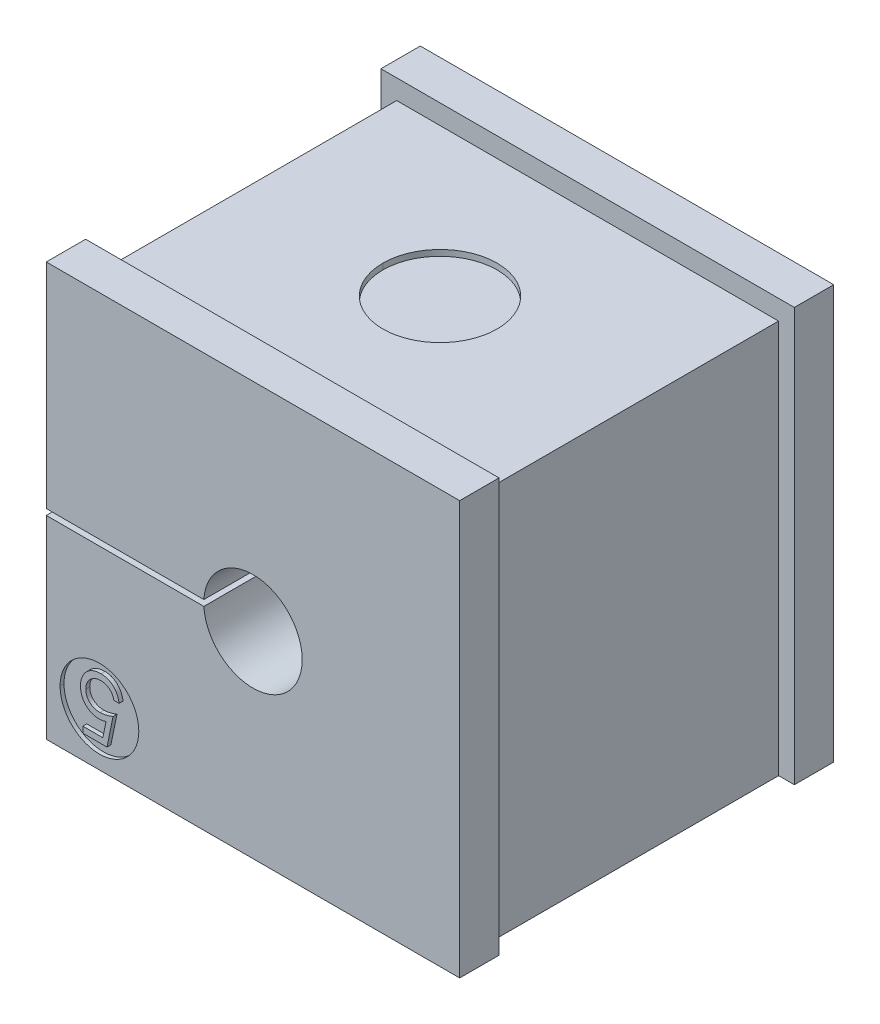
ISO-10303-21;
HEADER;
FILE_DESCRIPTION(('STEP AP214'),'2;1');
FILE_NAME('part.step','',(''),(''),'','','');
FILE_SCHEMA(('AUTOMOTIVE_DESIGN { 1 0 10303 214 1 1 1 1 }'));
ENDSEC;
DATA;
#1=APPLICATION_CONTEXT('core data for automotive mechanical design processes');
#2=APPLICATION_PROTOCOL_DEFINITION('international standard','automotive_design',2000,#1);
#3=PRODUCT_CONTEXT('',#1,'mechanical');
#4=PRODUCT('Part','Part','',(#3));
#5=PRODUCT_RELATED_PRODUCT_CATEGORY('part','',(#4));
#6=PRODUCT_DEFINITION_FORMATION('','',#4);
#7=PRODUCT_DEFINITION_CONTEXT('part definition',#1,'design');
#8=PRODUCT_DEFINITION('design','',#6,#7);
#9=PRODUCT_DEFINITION_SHAPE('','',#8);
#10=(LENGTH_UNIT() NAMED_UNIT(*) SI_UNIT(.MILLI.,.METRE.));
#11=(NAMED_UNIT(*) PLANE_ANGLE_UNIT() SI_UNIT($,.RADIAN.));
#12=(NAMED_UNIT(*) SI_UNIT($,.STERADIAN.) SOLID_ANGLE_UNIT());
#13=UNCERTAINTY_MEASURE_WITH_UNIT(LENGTH_MEASURE(1.E-05),#10,'distance_accuracy_value','');
#14=(GEOMETRIC_REPRESENTATION_CONTEXT(3) GLOBAL_UNCERTAINTY_ASSIGNED_CONTEXT((#13)) GLOBAL_UNIT_ASSIGNED_CONTEXT((#10,
#11,#12)) REPRESENTATION_CONTEXT('',''));
#15=CARTESIAN_POINT('',(0.,0.,0.));
#16=DIRECTION('',(0.,0.,1.));
#17=DIRECTION('',(1.,0.,0.));
#18=AXIS2_PLACEMENT_3D('',#15,#16,#17);
#19=CARTESIAN_POINT('',(2.8612927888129,-8.24509689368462,9.5));
#20=DIRECTION('',(0.,-2.79254823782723E-13,1.));
#21=DIRECTION('',(0.,-1.,-2.79254823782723E-13));
#22=AXIS2_PLACEMENT_3D('',#19,#20,#21);
#23=PLANE('',#22);
#24=DIRECTION('',(-1.,0.,0.));
#25=VECTOR('',#24,1.);
#26=CARTESIAN_POINT('',(3.08461538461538,-9.3,9.5));
#27=LINE('',#26,#25);
#28=CARTESIAN_POINT('',(3.08461538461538,-9.3,9.5));
#29=VERTEX_POINT('',#28);
#30=CARTESIAN_POINT('',(1.85384615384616,-9.3,9.5));
#31=VERTEX_POINT('',#30);
#32=EDGE_CURVE('E450',#29,#31,#27,.T.);
#33=ORIENTED_EDGE('',*,*,#32,.F.);
#34=DIRECTION('',(-0.200944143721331,-0.97960270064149,0.));
#35=VECTOR('',#34,1.);
#36=CARTESIAN_POINT('',(3.39230769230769,-7.8,9.5));
#37=LINE('',#36,#35);
#38=CARTESIAN_POINT('',(3.39230769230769,-7.8,9.5));
#39=VERTEX_POINT('',#38);
#40=EDGE_CURVE('E473',#39,#29,#37,.T.);
#41=ORIENTED_EDGE('',*,*,#40,.F.);
#42=CARTESIAN_POINT('',(2.73125,-7.95384615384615,9.5));
#43=CARTESIAN_POINT('',(2.75470530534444,-7.95336540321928,9.5));
#44=CARTESIAN_POINT('',(2.80272195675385,-7.95238123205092,9.5));
#45=CARTESIAN_POINT('',(2.87654747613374,-7.94463600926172,9.5));
#46=CARTESIAN_POINT('',(2.95378941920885,-7.93272072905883,9.5));
#47=CARTESIAN_POINT('',(3.0347476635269,-7.91554700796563,9.5));
#48=CARTESIAN_POINT('',(3.11920003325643,-7.89404432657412,9.5));
#49=CARTESIAN_POINT('',(3.2072869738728,-7.86719017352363,9.5));
#50=CARTESIAN_POINT('',(3.29901061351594,-7.83625757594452,9.5));
#51=CARTESIAN_POINT('',(3.36074719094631,-7.81226519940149,9.5));
#52=CARTESIAN_POINT('',(3.39230769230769,-7.8,9.5));
#53=(BOUNDED_CURVE() B_SPLINE_CURVE(3,(#42,#43,#44,#45,#46,#47,#48,#49,#50,#51,#52),
.UNSPECIFIED.,.F.,.F.) B_SPLINE_CURVE_WITH_KNOTS((4,1,1,1,1,1,1,1,4),(0.,0.103079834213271,
0.211020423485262,0.325963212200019,0.446499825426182,0.574634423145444,0.70889989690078,
0.851186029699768,1.),
.UNSPECIFIED.) CURVE() GEOMETRIC_REPRESENTATION_ITEM() RATIONAL_B_SPLINE_CURVE((1.,1.,1.,1.,1.,
1.,1.,1.,1.,1.,1.)) REPRESENTATION_ITEM(''));
#54=CARTESIAN_POINT('',(2.73125,-7.95384615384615,9.5));
#55=VERTEX_POINT('',#54);
#56=EDGE_CURVE('E472',#55,#39,#53,.T.);
#57=ORIENTED_EDGE('',*,*,#56,.F.);
#58=CARTESIAN_POINT('',(2.00769230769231,-7.29158653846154,9.5));
#59=CARTESIAN_POINT('',(2.00814815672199,-7.31566890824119,9.5));
#60=CARTESIAN_POINT('',(2.00903716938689,-7.36263518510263,9.5));
#61=CARTESIAN_POINT('',(2.01955088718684,-7.43128461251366,9.5));
#62=CARTESIAN_POINT('',(2.03371203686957,-7.49681427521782,9.5));
#63=CARTESIAN_POINT('',(2.05604672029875,-7.55861190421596,9.5));
#64=CARTESIAN_POINT('',(2.08317534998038,-7.61732266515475,9.5));
#65=CARTESIAN_POINT('',(2.11852283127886,-7.67149588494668,9.5));
#66=CARTESIAN_POINT('',(2.15760176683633,-7.72378041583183,9.5));
#67=CARTESIAN_POINT('',(2.20440146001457,-7.77071963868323,9.5));
#68=CARTESIAN_POINT('',(2.2550747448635,-7.8144043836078,9.5));
#69=CARTESIAN_POINT('',(2.31122989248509,-7.85145519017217,9.5));
#70=CARTESIAN_POINT('',(2.3712621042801,-7.88297852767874,9.5));
#71=CARTESIAN_POINT('',(2.43531128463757,-7.90880247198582,9.5));
#72=CARTESIAN_POINT('',(2.50344853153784,-7.92937426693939,9.5));
#73=CARTESIAN_POINT('',(2.57571270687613,-7.94359145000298,9.5));
#74=CARTESIAN_POINT('',(2.65211967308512,-7.95209886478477,9.5));
#75=CARTESIAN_POINT('',(2.70438451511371,-7.95325293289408,9.5));
#76=CARTESIAN_POINT('',(2.73125,-7.95384615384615,9.5));
#77=(BOUNDED_CURVE() B_SPLINE_CURVE(3,(#58,#59,#60,#61,#62,#63,#64,#65,#66,#67,#68,#69,#70,#71,
#72,#73,#74,#75,#76),.UNSPECIFIED.,.F.,.F.) B_SPLINE_CURVE_WITH_KNOTS((4,1,1,1,1,1,1,1,1,1,1,1,
1,1,1,1,4),(0.,0.0653638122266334,0.127474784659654,0.188335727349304,0.247202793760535,
0.305627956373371,0.363605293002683,0.422603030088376,0.482640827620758,0.543265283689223,
0.604094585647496,0.664953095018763,0.727206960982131,0.791427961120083,0.858028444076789,
0.927022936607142,1.),
.UNSPECIFIED.) CURVE() GEOMETRIC_REPRESENTATION_ITEM() RATIONAL_B_SPLINE_CURVE((1.,1.,1.,1.,1.,
1.,1.,1.,1.,1.,1.,1.,1.,1.,1.,1.,1.,1.,1.)) REPRESENTATION_ITEM(''));
#78=CARTESIAN_POINT('',(2.00769230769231,-7.29158653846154,9.5));
#79=VERTEX_POINT('',#78);
#80=EDGE_CURVE('E837',#79,#55,#77,.T.);
#81=ORIENTED_EDGE('',*,*,#80,.F.);
#82=CARTESIAN_POINT('',(2.76911057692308,-6.53076923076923,9.5));
#83=CARTESIAN_POINT('',(2.74343408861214,-6.53147864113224,9.5));
#84=CARTESIAN_POINT('',(2.69287687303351,-6.53287547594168,9.5));
#85=CARTESIAN_POINT('',(2.61843586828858,-6.54345305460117,9.5));
#86=CARTESIAN_POINT('',(2.5467759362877,-6.56017165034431,9.5));
#87=CARTESIAN_POINT('',(2.47776987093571,-6.58359344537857,9.5));
#88=CARTESIAN_POINT('',(2.41175675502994,-6.61457910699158,9.5));
#89=CARTESIAN_POINT('',(2.3488299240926,-6.65264320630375,9.5));
#90=CARTESIAN_POINT('',(2.28809292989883,-6.69683607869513,9.5));
#91=CARTESIAN_POINT('',(2.23114427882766,-6.74734691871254,9.5));
#92=CARTESIAN_POINT('',(2.17899892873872,-6.80304150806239,9.5));
#93=CARTESIAN_POINT('',(2.1329215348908,-6.86259191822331,9.5));
#94=CARTESIAN_POINT('',(2.09454151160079,-6.92612107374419,9.5));
#95=CARTESIAN_POINT('',(2.06219793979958,-6.99252651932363,9.5));
#96=CARTESIAN_POINT('',(2.03763798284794,-7.06253674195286,9.5));
#97=CARTESIAN_POINT('',(2.02011713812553,-7.13582345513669,9.5));
#98=CARTESIAN_POINT('',(2.00982880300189,-7.21256772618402,9.5));
#99=CARTESIAN_POINT('',(2.00841350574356,-7.26491284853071,9.5));
#100=CARTESIAN_POINT('',(2.00769230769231,-7.29158653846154,9.5));
#101=(BOUNDED_CURVE() B_SPLINE_CURVE(3,(#82,#83,#84,#85,#86,#87,#88,#89,#90,#91,#92,#93,#94,#95,
#96,#97,#98,#99,#100),.UNSPECIFIED.,.F.,.F.) B_SPLINE_CURVE_WITH_KNOTS((4,1,1,1,1,1,1,1,1,1,1,1,
1,1,1,1,4),(0.,0.0642043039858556,0.126418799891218,0.187671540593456,0.248040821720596,
0.30833728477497,0.369690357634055,0.431725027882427,0.495970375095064,0.559778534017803,
0.622313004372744,0.683925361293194,0.745104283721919,0.806749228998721,0.86909271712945,
0.933293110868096,1.),
.UNSPECIFIED.) CURVE() GEOMETRIC_REPRESENTATION_ITEM() RATIONAL_B_SPLINE_CURVE((1.,1.,1.,1.,1.,
1.,1.,1.,1.,1.,1.,1.,1.,1.,1.,1.,1.,1.,1.)) REPRESENTATION_ITEM(''));
#102=CARTESIAN_POINT('',(2.76911057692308,-6.53076923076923,9.5));
#103=VERTEX_POINT('',#102);
#104=EDGE_CURVE('E363',#103,#79,#101,.T.);
#105=ORIENTED_EDGE('',*,*,#104,.F.);
#106=CARTESIAN_POINT('',(3.43076923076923,-7.06923076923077,9.5));
#107=CARTESIAN_POINT('',(3.42415307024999,-7.04061663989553,9.5));
#108=CARTESIAN_POINT('',(3.41143644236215,-6.98561869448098,9.5));
#109=CARTESIAN_POINT('',(3.38337797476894,-6.90843966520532,9.5));
#110=CARTESIAN_POINT('',(3.34961436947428,-6.83937780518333,9.5));
#111=CARTESIAN_POINT('',(3.30760435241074,-6.77886742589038,9.5));
#112=CARTESIAN_POINT('',(3.25988547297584,-6.72487174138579,9.5));
#113=CARTESIAN_POINT('',(3.20481016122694,-6.67685483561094,9.5));
#114=CARTESIAN_POINT('',(3.14284644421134,-6.63405762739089,9.5));
#115=CARTESIAN_POINT('',(3.07398048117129,-6.59809255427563,9.5));
#116=CARTESIAN_POINT('',(3.00114159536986,-6.56784158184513,9.5));
#117=CARTESIAN_POINT('',(2.92535279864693,-6.54624271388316,9.5));
#118=CARTESIAN_POINT('',(2.84769026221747,-6.53317099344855,9.5));
#119=CARTESIAN_POINT('',(2.79540238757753,-6.53157283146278,9.5));
#120=CARTESIAN_POINT('',(2.76911057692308,-6.53076923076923,9.5));
#121=(BOUNDED_CURVE() B_SPLINE_CURVE(3,(#106,#107,#108,#109,#110,#111,#112,#113,#114,#115,#116,
#117,#118,#119,#120),.UNSPECIFIED.,.F.,.F.) B_SPLINE_CURVE_WITH_KNOTS((4,1,1,1,1,1,1,1,1,1,1,1,
4),(0.,0.0946975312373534,0.182013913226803,0.264405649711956,0.342044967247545,
0.418973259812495,0.496386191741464,0.577254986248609,0.661405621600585,0.746636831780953,
0.831346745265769,0.915196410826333,1.),
.UNSPECIFIED.) CURVE() GEOMETRIC_REPRESENTATION_ITEM() RATIONAL_B_SPLINE_CURVE((1.,1.,1.,1.,1.,
1.,1.,1.,1.,1.,1.,1.,1.,1.,1.)) REPRESENTATION_ITEM(''));
#122=CARTESIAN_POINT('',(3.43076923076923,-7.06923076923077,9.5));
#123=VERTEX_POINT('',#122);
#124=EDGE_CURVE('E360',#123,#103,#121,.T.);
#125=ORIENTED_EDGE('',*,*,#124,.F.);
#126=DIRECTION('',(-1.,0.,0.));
#127=VECTOR('',#126,1.);
#128=CARTESIAN_POINT('',(3.7,-7.06923076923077,9.5));
#129=LINE('',#128,#127);
#130=CARTESIAN_POINT('',(3.7,-7.06923076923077,9.5));
#131=VERTEX_POINT('',#130);
#132=EDGE_CURVE('E346',#131,#123,#129,.T.);
#133=ORIENTED_EDGE('',*,*,#132,.F.);
#134=CARTESIAN_POINT('',(2.78473557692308,-6.22307692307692,9.5));
#135=CARTESIAN_POINT('',(2.81462693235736,-6.22367071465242,9.5));
#136=CARTESIAN_POINT('',(2.87343464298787,-6.22483892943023,9.5));
#137=CARTESIAN_POINT('',(2.95960652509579,-6.23700275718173,9.5));
#138=CARTESIAN_POINT('',(3.04246314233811,-6.25454316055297,9.5));
#139=CARTESIAN_POINT('',(3.12166084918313,-6.28051627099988,9.5));
#140=CARTESIAN_POINT('',(3.19682720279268,-6.31457582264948,9.5));
#141=CARTESIAN_POINT('',(3.26905256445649,-6.35478340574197,9.5));
#142=CARTESIAN_POINT('',(3.33701485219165,-6.40331236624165,9.5));
#143=CARTESIAN_POINT('',(3.40119622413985,-6.45842296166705,9.5));
#144=CARTESIAN_POINT('',(3.46007180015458,-6.51954752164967,9.5));
#145=CARTESIAN_POINT('',(3.51427340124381,-6.58453212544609,9.5));
#146=CARTESIAN_POINT('',(3.56120519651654,-6.6548181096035,9.5));
#147=CARTESIAN_POINT('',(3.60198429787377,-6.72923288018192,9.5));
#148=CARTESIAN_POINT('',(3.63667413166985,-6.80797043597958,9.5));
#149=CARTESIAN_POINT('',(3.6639503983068,-6.89121353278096,9.5));
#150=CARTESIAN_POINT('',(3.685958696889,-6.97855781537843,9.5));
#151=CARTESIAN_POINT('',(3.69527043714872,-7.03868919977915,9.5));
#152=CARTESIAN_POINT('',(3.7,-7.06923076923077,9.5));
#153=(BOUNDED_CURVE() B_SPLINE_CURVE(3,(#134,#135,#136,#137,#138,#139,#140,#141,#142,#143,#144,
#145,#146,#147,#148,#149,#150,#151,#152),.UNSPECIFIED.,.F.,.F.) B_SPLINE_CURVE_WITH_KNOTS((4,1,
1,1,1,1,1,1,1,1,1,1,1,1,1,1,4),(0.,0.0654348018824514,0.128735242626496,0.190275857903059,
0.250776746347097,0.310880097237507,0.370805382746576,0.431558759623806,0.493479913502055,
0.555853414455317,0.617262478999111,0.678600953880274,0.740657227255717,0.802944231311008,
0.866774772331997,0.932333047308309,1.),
.UNSPECIFIED.) CURVE() GEOMETRIC_REPRESENTATION_ITEM() RATIONAL_B_SPLINE_CURVE((1.,1.,1.,1.,1.,
1.,1.,1.,1.,1.,1.,1.,1.,1.,1.,1.,1.,1.,1.)) REPRESENTATION_ITEM(''));
#154=CARTESIAN_POINT('',(2.78473557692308,-6.22307692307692,9.5));
#155=VERTEX_POINT('',#154);
#156=EDGE_CURVE('E392',#155,#131,#153,.T.);
#157=ORIENTED_EDGE('',*,*,#156,.F.);
#158=CARTESIAN_POINT('',(1.73846153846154,-7.28016826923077,9.5));
#159=CARTESIAN_POINT('',(1.73903203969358,-7.25572077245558,9.5));
#160=CARTESIAN_POINT('',(1.74016533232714,-7.20715616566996,9.5));
#161=CARTESIAN_POINT('',(1.74591771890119,-7.13503079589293,9.5));
#162=CARTESIAN_POINT('',(1.75702929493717,-7.0644406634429,9.5));
#163=CARTESIAN_POINT('',(1.77178766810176,-6.99552559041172,9.5));
#164=CARTESIAN_POINT('',(1.79141214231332,-6.92818273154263,9.5));
#165=CARTESIAN_POINT('',(1.81461905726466,-6.86225319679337,9.5));
#166=CARTESIAN_POINT('',(1.84239616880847,-6.79784605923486,9.5));
#167=CARTESIAN_POINT('',(1.8740936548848,-6.7352818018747,9.5));
#168=CARTESIAN_POINT('',(1.91015708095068,-6.67579184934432,9.5));
#169=CARTESIAN_POINT('',(1.94864486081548,-6.61868301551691,9.5));
#170=CARTESIAN_POINT('',(1.99058318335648,-6.56561208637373,9.5));
#171=CARTESIAN_POINT('',(2.0352378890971,-6.5156919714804,9.5));
#172=CARTESIAN_POINT('',(2.08346638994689,-6.47035846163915,9.5));
#173=CARTESIAN_POINT('',(2.1340851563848,-6.42772044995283,9.5));
#174=CARTESIAN_POINT('',(2.18822612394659,-6.3895864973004,9.5));
#175=CARTESIAN_POINT('',(2.24493483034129,-6.35451420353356,9.5));
#176=CARTESIAN_POINT('',(2.3041714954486,-6.32311121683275,9.5));
#177=CARTESIAN_POINT('',(2.36653785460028,-6.29691567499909,9.5));
#178=CARTESIAN_POINT('',(2.43066451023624,-6.27395501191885,9.5));
#179=CARTESIAN_POINT('',(2.4971230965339,-6.25528329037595,9.5));
#180=CARTESIAN_POINT('',(2.56578484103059,-6.24079673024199,9.5));
#181=CARTESIAN_POINT('',(2.63688619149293,-6.23093157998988,9.5));
#182=CARTESIAN_POINT('',(2.71007037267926,-6.22375382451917,9.5));
#183=CARTESIAN_POINT('',(2.75967742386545,-6.22330409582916,9.5));
#184=CARTESIAN_POINT('',(2.78473557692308,-6.22307692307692,9.5));
#185=(BOUNDED_CURVE() B_SPLINE_CURVE(3,(#158,#159,#160,#161,#162,#163,#164,#165,#166,#167,#168,
#169,#170,#171,#172,#173,#174,#175,#176,#177,#178,#179,#180,#181,#182,#183,#184),.UNSPECIFIED.,
.F.,.F.) B_SPLINE_CURVE_WITH_KNOTS((4,1,1,1,1,1,1,1,1,1,1,1,1,1,1,1,1,1,1,1,1,1,1,1,4),(0.,
0.044011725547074,0.0874286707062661,0.130110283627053,0.172542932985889,0.214194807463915,
0.256275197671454,0.298268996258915,0.340355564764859,0.382403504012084,0.42340579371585,
0.464231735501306,0.504056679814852,0.543842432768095,0.583267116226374,0.623085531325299,
0.662910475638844,0.70323015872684,0.743614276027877,0.784554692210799,0.825760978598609,
0.867765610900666,0.910750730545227,0.954917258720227,1.),
.UNSPECIFIED.) CURVE() GEOMETRIC_REPRESENTATION_ITEM() RATIONAL_B_SPLINE_CURVE((1.,1.,1.,1.,1.,
1.,1.,1.,1.,1.,1.,1.,1.,1.,1.,1.,1.,1.,1.,1.,1.,1.,1.,1.,1.,1.,1.)) REPRESENTATION_ITEM(''));
#186=CARTESIAN_POINT('',(1.73846153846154,-7.28016826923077,9.5));
#187=VERTEX_POINT('',#186);
#188=EDGE_CURVE('E407',#187,#155,#185,.T.);
#189=ORIENTED_EDGE('',*,*,#188,.F.);
#190=CARTESIAN_POINT('',(2.68257211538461,-8.26153846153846,9.5));
#191=CARTESIAN_POINT('',(2.64906573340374,-8.26083712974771,9.5));
#192=CARTESIAN_POINT('',(2.58318381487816,-8.25945813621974,9.5));
#193=CARTESIAN_POINT('',(2.48693848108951,-8.24543698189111,9.5));
#194=CARTESIAN_POINT('',(2.3946067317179,-8.22511476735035,9.5));
#195=CARTESIAN_POINT('',(2.30751663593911,-8.19385532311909,9.5));
#196=CARTESIAN_POINT('',(2.22426412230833,-8.1554359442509,9.5));
#197=CARTESIAN_POINT('',(2.14597788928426,-8.10767396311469,9.5));
#198=CARTESIAN_POINT('',(2.07229019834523,-8.05124996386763,9.5));
#199=CARTESIAN_POINT('',(2.00336211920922,-7.98732141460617,9.5));
#200=CARTESIAN_POINT('',(1.94122103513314,-7.91614397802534,9.5));
#201=CARTESIAN_POINT('',(1.88700627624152,-7.83955069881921,9.5));
#202=CARTESIAN_POINT('',(1.84066565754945,-7.75839624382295,9.5));
#203=CARTESIAN_POINT('',(1.80369956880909,-7.67193413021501,9.5));
#204=CARTESIAN_POINT('',(1.7737281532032,-7.58097917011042,9.5));
#205=CARTESIAN_POINT('',(1.75391101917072,-7.48476815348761,9.5));
#206=CARTESIAN_POINT('',(1.74068911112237,-7.38410156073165,9.5));
#207=CARTESIAN_POINT('',(1.73921383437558,-7.31526862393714,9.5));
#208=CARTESIAN_POINT('',(1.73846153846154,-7.28016826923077,9.5));
#209=(BOUNDED_CURVE() B_SPLINE_CURVE(3,(#190,#191,#192,#193,#194,#195,#196,#197,#198,#199,#200,
#201,#202,#203,#204,#205,#206,#207,#208),.UNSPECIFIED.,.F.,.F.) B_SPLINE_CURVE_WITH_KNOTS((4,1,
1,1,1,1,1,1,1,1,1,1,1,1,1,1,4),(0.,0.0657910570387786,0.129361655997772,0.190756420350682,
0.251257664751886,0.310776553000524,0.370653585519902,0.431035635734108,0.49286417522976,
0.555071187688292,0.616339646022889,0.6769764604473,0.738325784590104,0.800812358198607,
0.864811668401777,0.931062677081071,1.),
.UNSPECIFIED.) CURVE() GEOMETRIC_REPRESENTATION_ITEM() RATIONAL_B_SPLINE_CURVE((1.,1.,1.,1.,1.,
1.,1.,1.,1.,1.,1.,1.,1.,1.,1.,1.,1.,1.,1.)) REPRESENTATION_ITEM(''));
#210=CARTESIAN_POINT('',(2.68257211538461,-8.26153846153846,9.5));
#211=VERTEX_POINT('',#210);
#212=EDGE_CURVE('E546',#211,#187,#209,.T.);
#213=ORIENTED_EDGE('',*,*,#212,.F.);
#214=CARTESIAN_POINT('',(3.0359375,-8.20324519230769,9.5));
#215=CARTESIAN_POINT('',(3.00417532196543,-8.21201399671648,9.5));
#216=CARTESIAN_POINT('',(2.94264112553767,-8.22900216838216,9.5));
#217=CARTESIAN_POINT('',(2.85181838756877,-8.24786425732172,9.5));
#218=CARTESIAN_POINT('',(2.76559649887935,-8.25923463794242,9.5));
#219=CARTESIAN_POINT('',(2.70964618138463,-8.26078718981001,9.5));
#220=CARTESIAN_POINT('',(2.68257211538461,-8.26153846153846,9.5));
#221=(BOUNDED_CURVE() B_SPLINE_CURVE(3,(#214,#215,#216,#217,#218,#219,#220),.UNSPECIFIED.,.F.,
.F.) B_SPLINE_CURVE_WITH_KNOTS((4,1,1,1,4),(0.,0.275068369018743,0.532901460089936,
0.773973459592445,1.),
.UNSPECIFIED.) CURVE() GEOMETRIC_REPRESENTATION_ITEM() RATIONAL_B_SPLINE_CURVE((1.,1.,1.,1.,1.,
1.,1.)) REPRESENTATION_ITEM(''));
#222=CARTESIAN_POINT('',(3.0359375,-8.20324519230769,9.5));
#223=VERTEX_POINT('',#222);
#224=EDGE_CURVE('E422',#223,#211,#221,.T.);
#225=ORIENTED_EDGE('',*,*,#224,.F.);
#226=DIRECTION('',(0.200705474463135,0.97965162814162,0.));
#227=VECTOR('',#226,1.);
#228=CARTESIAN_POINT('',(2.87427884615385,-8.99230769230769,9.5));
#229=LINE('',#228,#227);
#230=CARTESIAN_POINT('',(2.87427884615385,-8.99230769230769,9.5));
#231=VERTEX_POINT('',#230);
#232=EDGE_CURVE('E396',#231,#223,#229,.T.);
#233=ORIENTED_EDGE('',*,*,#232,.F.);
#234=DIRECTION('',(1.,0.,0.));
#235=VECTOR('',#234,1.);
#236=CARTESIAN_POINT('',(1.85384615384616,-8.99230769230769,9.5));
#237=LINE('',#236,#235);
#238=CARTESIAN_POINT('',(1.85384615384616,-8.99230769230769,9.5));
#239=VERTEX_POINT('',#238);
#240=EDGE_CURVE('E23',#239,#231,#237,.T.);
#241=ORIENTED_EDGE('',*,*,#240,.F.);
#242=DIRECTION('',(0.,1.,0.));
#243=VECTOR('',#242,1.);
#244=CARTESIAN_POINT('',(1.85384615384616,-9.3,9.5));
#245=LINE('',#244,#243);
#246=EDGE_CURVE('E9',#31,#239,#245,.T.);
#247=ORIENTED_EDGE('',*,*,#246,.F.);
#248=EDGE_LOOP('',(#33,#41,#57,#81,#105,#125,#133,#157,#189,#213,#225,#233,#241,#247));
#249=FACE_BOUND('',#248,.T.);
#250=ADVANCED_FACE('F15',(#249),#23,.T.);
#251=CARTESIAN_POINT('',(1.85384615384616,-9.3,9.5));
#252=DIRECTION('',(-1.,0.,0.));
#253=DIRECTION('',(0.,0.,1.));
#254=AXIS2_PLACEMENT_3D('',#251,#252,#253);
#255=PLANE('',#254);
#256=DIRECTION('',(0.,1.,0.));
#257=VECTOR('',#256,1.);
#258=CARTESIAN_POINT('',(1.85384615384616,-9.3,9.3));
#259=LINE('',#258,#257);
#260=CARTESIAN_POINT('',(1.85384615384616,-9.3,9.3));
#261=VERTEX_POINT('',#260);
#262=CARTESIAN_POINT('',(1.85384615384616,-8.99230769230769,9.3));
#263=VERTEX_POINT('',#262);
#264=EDGE_CURVE('E605',#261,#263,#259,.T.);
#265=ORIENTED_EDGE('',*,*,#264,.F.);
#266=DIRECTION('',(0.,0.,-1.));
#267=VECTOR('',#266,1.);
#268=CARTESIAN_POINT('',(1.85384615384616,-9.3,9.5));
#269=LINE('',#268,#267);
#270=EDGE_CURVE('E454',#31,#261,#269,.T.);
#271=ORIENTED_EDGE('',*,*,#270,.F.);
#272=ORIENTED_EDGE('',*,*,#246,.T.);
#273=DIRECTION('',(0.,0.,-1.));
#274=VECTOR('',#273,1.);
#275=CARTESIAN_POINT('',(1.85384615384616,-8.99230769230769,9.5));
#276=LINE('',#275,#274);
#277=EDGE_CURVE('E393',#239,#263,#276,.T.);
#278=ORIENTED_EDGE('',*,*,#277,.T.);
#279=EDGE_LOOP('',(#265,#271,#272,#278));
#280=FACE_BOUND('',#279,.T.);
#281=ADVANCED_FACE('F966',(#280),#255,.T.);
#282=CARTESIAN_POINT('',(1.85384615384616,-8.99230769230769,9.5));
#283=DIRECTION('',(0.,1.,0.));
#284=DIRECTION('',(1.,0.,0.));
#285=AXIS2_PLACEMENT_3D('',#282,#283,#284);
#286=PLANE('',#285);
#287=DIRECTION('',(1.,0.,0.));
#288=VECTOR('',#287,1.);
#289=CARTESIAN_POINT('',(1.85384615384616,-8.99230769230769,9.3));
#290=LINE('',#289,#288);
#291=CARTESIAN_POINT('',(2.87427884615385,-8.99230769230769,9.3));
#292=VERTEX_POINT('',#291);
#293=EDGE_CURVE('E609',#263,#292,#290,.T.);
#294=ORIENTED_EDGE('',*,*,#293,.F.);
#295=ORIENTED_EDGE('',*,*,#277,.F.);
#296=ORIENTED_EDGE('',*,*,#240,.T.);
#297=DIRECTION('',(0.,0.,-1.));
#298=VECTOR('',#297,1.);
#299=CARTESIAN_POINT('',(2.87427884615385,-8.99230769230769,9.5));
#300=LINE('',#299,#298);
#301=EDGE_CURVE('E416',#231,#292,#300,.T.);
#302=ORIENTED_EDGE('',*,*,#301,.T.);
#303=EDGE_LOOP('',(#294,#295,#296,#302));
#304=FACE_BOUND('',#303,.T.);
#305=ADVANCED_FACE('F970',(#304),#286,.T.);
#306=CARTESIAN_POINT('',(2.87427884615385,-8.99230769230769,9.5));
#307=DIRECTION('',(-0.97965162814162,0.200705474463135,0.));
#308=DIRECTION('',(0.,0.,1.));
#309=AXIS2_PLACEMENT_3D('',#306,#307,#308);
#310=PLANE('',#309);
#311=DIRECTION('',(0.200705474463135,0.97965162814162,0.));
#312=VECTOR('',#311,1.);
#313=CARTESIAN_POINT('',(2.87427884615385,-8.99230769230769,9.3));
#314=LINE('',#313,#312);
#315=CARTESIAN_POINT('',(3.0359375,-8.20324519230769,9.3));
#316=VERTEX_POINT('',#315);
#317=EDGE_CURVE('E595',#292,#316,#314,.T.);
#318=ORIENTED_EDGE('',*,*,#317,.F.);
#319=ORIENTED_EDGE('',*,*,#301,.F.);
#320=ORIENTED_EDGE('',*,*,#232,.T.);
#321=DIRECTION('',(0.,0.,-1.));
#322=VECTOR('',#321,1.);
#323=CARTESIAN_POINT('',(3.0359375,-8.20324519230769,9.5));
#324=LINE('',#323,#322);
#325=EDGE_CURVE('E380',#223,#316,#324,.T.);
#326=ORIENTED_EDGE('',*,*,#325,.T.);
#327=EDGE_LOOP('',(#318,#319,#320,#326));
#328=FACE_BOUND('',#327,.T.);
#329=ADVANCED_FACE('F974',(#328),#310,.T.);
#330=CARTESIAN_POINT('',(3.0359375,-8.20324519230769,9.5));
#331=CARTESIAN_POINT('',(3.0359375,-8.20324519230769,9.3));
#332=CARTESIAN_POINT('',(3.00417532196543,-8.21201399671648,9.5));
#333=CARTESIAN_POINT('',(3.00417532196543,-8.21201399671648,9.3));
#334=CARTESIAN_POINT('',(2.94264112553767,-8.22900216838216,9.5));
#335=CARTESIAN_POINT('',(2.94264112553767,-8.22900216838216,9.3));
#336=CARTESIAN_POINT('',(2.85181838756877,-8.24786425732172,9.5));
#337=CARTESIAN_POINT('',(2.85181838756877,-8.24786425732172,9.3));
#338=CARTESIAN_POINT('',(2.76559649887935,-8.25923463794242,9.5));
#339=CARTESIAN_POINT('',(2.76559649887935,-8.25923463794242,9.3));
#340=CARTESIAN_POINT('',(2.70964618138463,-8.26078718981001,9.5));
#341=CARTESIAN_POINT('',(2.70964618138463,-8.26078718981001,9.3));
#342=CARTESIAN_POINT('',(2.68257211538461,-8.26153846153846,9.5));
#343=CARTESIAN_POINT('',(2.68257211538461,-8.26153846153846,9.3));
#344=(BOUNDED_SURFACE() B_SPLINE_SURFACE(3,1,((#330,#331),(#332,#333),(#334,#335),(#336,#337),
(#338,#339),(#340,#341),(#342,#343)),.UNSPECIFIED.,.F.,.F.,.F.) B_SPLINE_SURFACE_WITH_KNOTS((4,
1,1,1,4),(2,2),(0.,0.275068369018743,0.532901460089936,0.773973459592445,1.),(0.,1.),
.UNSPECIFIED.) GEOMETRIC_REPRESENTATION_ITEM() RATIONAL_B_SPLINE_SURFACE(((1.,1.),(1.,1.),(1.,
1.),(1.,1.),(1.,1.),(1.,1.),(1.,1.))) REPRESENTATION_ITEM('') SURFACE());
#345=CARTESIAN_POINT('',(3.0359375,-8.20324519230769,9.3));
#346=CARTESIAN_POINT('',(3.00417532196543,-8.21201399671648,9.3));
#347=CARTESIAN_POINT('',(2.94264112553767,-8.22900216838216,9.3));
#348=CARTESIAN_POINT('',(2.85181838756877,-8.24786425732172,9.3));
#349=CARTESIAN_POINT('',(2.76559649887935,-8.25923463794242,9.3));
#350=CARTESIAN_POINT('',(2.70964618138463,-8.26078718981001,9.3));
#351=CARTESIAN_POINT('',(2.68257211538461,-8.26153846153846,9.3));
#352=(BOUNDED_CURVE() B_SPLINE_CURVE(3,(#345,#346,#347,#348,#349,#350,#351),.UNSPECIFIED.,.F.,
.F.) B_SPLINE_CURVE_WITH_KNOTS((4,1,1,1,4),(0.,0.275068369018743,0.532901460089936,
0.773973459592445,1.),
.UNSPECIFIED.) CURVE() GEOMETRIC_REPRESENTATION_ITEM() RATIONAL_B_SPLINE_CURVE((1.,1.,1.,1.,1.,
1.,1.)) REPRESENTATION_ITEM(''));
#353=CARTESIAN_POINT('',(2.68257211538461,-8.26153846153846,9.3));
#354=VERTEX_POINT('',#353);
#355=EDGE_CURVE('E588',#316,#354,#352,.T.);
#356=DIRECTION('',(0.,0.,-1.));
#357=VECTOR('',#356,1.);
#358=CARTESIAN_POINT('',(2.68257211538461,-8.26153846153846,9.5));
#359=LINE('',#358,#357);
#360=EDGE_CURVE('E411',#211,#354,#359,.T.);
#361=ORIENTED_EDGE('',*,*,#355,.F.);
#362=ORIENTED_EDGE('',*,*,#325,.F.);
#363=ORIENTED_EDGE('',*,*,#224,.T.);
#364=ORIENTED_EDGE('',*,*,#360,.T.);
#365=EDGE_LOOP('',(#361,#362,#363,#364));
#366=FACE_BOUND('',#365,.T.);
#367=ADVANCED_FACE('F978',(#366),#344,.T.);
#368=CARTESIAN_POINT('',(2.68257211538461,-8.26153846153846,9.5));
#369=CARTESIAN_POINT('',(2.68257211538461,-8.26153846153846,9.3));
#370=CARTESIAN_POINT('',(2.64906573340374,-8.26083712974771,9.5));
#371=CARTESIAN_POINT('',(2.64906573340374,-8.26083712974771,9.3));
#372=CARTESIAN_POINT('',(2.58318381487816,-8.25945813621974,9.5));
#373=CARTESIAN_POINT('',(2.58318381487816,-8.25945813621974,9.3));
#374=CARTESIAN_POINT('',(2.48693848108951,-8.24543698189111,9.5));
#375=CARTESIAN_POINT('',(2.48693848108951,-8.24543698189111,9.3));
#376=CARTESIAN_POINT('',(2.3946067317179,-8.22511476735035,9.5));
#377=CARTESIAN_POINT('',(2.3946067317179,-8.22511476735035,9.3));
#378=CARTESIAN_POINT('',(2.30751663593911,-8.19385532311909,9.5));
#379=CARTESIAN_POINT('',(2.30751663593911,-8.19385532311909,9.3));
#380=CARTESIAN_POINT('',(2.22426412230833,-8.1554359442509,9.5));
#381=CARTESIAN_POINT('',(2.22426412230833,-8.1554359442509,9.3));
#382=CARTESIAN_POINT('',(2.14597788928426,-8.10767396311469,9.5));
#383=CARTESIAN_POINT('',(2.14597788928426,-8.10767396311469,9.3));
#384=CARTESIAN_POINT('',(2.07229019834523,-8.05124996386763,9.5));
#385=CARTESIAN_POINT('',(2.07229019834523,-8.05124996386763,9.3));
#386=CARTESIAN_POINT('',(2.00336211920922,-7.98732141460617,9.5));
#387=CARTESIAN_POINT('',(2.00336211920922,-7.98732141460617,9.3));
#388=CARTESIAN_POINT('',(1.94122103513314,-7.91614397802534,9.5));
#389=CARTESIAN_POINT('',(1.94122103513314,-7.91614397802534,9.3));
#390=CARTESIAN_POINT('',(1.88700627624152,-7.83955069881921,9.5));
#391=CARTESIAN_POINT('',(1.88700627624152,-7.83955069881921,9.3));
#392=CARTESIAN_POINT('',(1.84066565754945,-7.75839624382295,9.5));
#393=CARTESIAN_POINT('',(1.84066565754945,-7.75839624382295,9.3));
#394=CARTESIAN_POINT('',(1.80369956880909,-7.67193413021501,9.5));
#395=CARTESIAN_POINT('',(1.80369956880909,-7.67193413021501,9.3));
#396=CARTESIAN_POINT('',(1.7737281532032,-7.58097917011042,9.5));
#397=CARTESIAN_POINT('',(1.7737281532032,-7.58097917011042,9.3));
#398=CARTESIAN_POINT('',(1.75391101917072,-7.48476815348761,9.5));
#399=CARTESIAN_POINT('',(1.75391101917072,-7.48476815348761,9.3));
#400=CARTESIAN_POINT('',(1.74068911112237,-7.38410156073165,9.5));
#401=CARTESIAN_POINT('',(1.74068911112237,-7.38410156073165,9.3));
#402=CARTESIAN_POINT('',(1.73921383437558,-7.31526862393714,9.5));
#403=CARTESIAN_POINT('',(1.73921383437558,-7.31526862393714,9.3));
#404=CARTESIAN_POINT('',(1.73846153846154,-7.28016826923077,9.5));
#405=CARTESIAN_POINT('',(1.73846153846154,-7.28016826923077,9.3));
#406=(BOUNDED_SURFACE() B_SPLINE_SURFACE(3,1,((#368,#369),(#370,#371),(#372,#373),(#374,#375),
(#376,#377),(#378,#379),(#380,#381),(#382,#383),(#384,#385),(#386,#387),(#388,#389),(#390,#391),
(#392,#393),(#394,#395),(#396,#397),(#398,#399),(#400,#401),(#402,#403),(#404,#405)),
.UNSPECIFIED.,.F.,.F.,.F.) B_SPLINE_SURFACE_WITH_KNOTS((4,1,1,1,1,1,1,1,1,1,1,1,1,1,1,1,4),(2,
2),(0.,0.0657910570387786,0.129361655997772,0.190756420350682,0.251257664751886,
0.310776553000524,0.370653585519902,0.431035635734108,0.49286417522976,0.555071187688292,
0.616339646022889,0.6769764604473,0.738325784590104,0.800812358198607,0.864811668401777,
0.931062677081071,1.),(0.,1.),
.UNSPECIFIED.) GEOMETRIC_REPRESENTATION_ITEM() RATIONAL_B_SPLINE_SURFACE(((1.,1.),(1.,1.),(1.,
1.),(1.,1.),(1.,1.),(1.,1.),(1.,1.),(1.,1.),(1.,1.),(1.,1.),(1.,1.),(1.,1.),(1.,1.),(1.,1.),(1.,
1.),(1.,1.),(1.,1.),(1.,1.),(1.,1.))) REPRESENTATION_ITEM('') SURFACE());
#407=CARTESIAN_POINT('',(2.68257211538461,-8.26153846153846,9.3));
#408=CARTESIAN_POINT('',(2.64906573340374,-8.26083712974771,9.3));
#409=CARTESIAN_POINT('',(2.58318381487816,-8.25945813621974,9.3));
#410=CARTESIAN_POINT('',(2.48693848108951,-8.24543698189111,9.3));
#411=CARTESIAN_POINT('',(2.3946067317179,-8.22511476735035,9.3));
#412=CARTESIAN_POINT('',(2.30751663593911,-8.19385532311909,9.3));
#413=CARTESIAN_POINT('',(2.22426412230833,-8.1554359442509,9.3));
#414=CARTESIAN_POINT('',(2.14597788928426,-8.10767396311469,9.3));
#415=CARTESIAN_POINT('',(2.07229019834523,-8.05124996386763,9.3));
#416=CARTESIAN_POINT('',(2.00336211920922,-7.98732141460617,9.3));
#417=CARTESIAN_POINT('',(1.94122103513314,-7.91614397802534,9.3));
#418=CARTESIAN_POINT('',(1.88700627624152,-7.83955069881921,9.3));
#419=CARTESIAN_POINT('',(1.84066565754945,-7.75839624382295,9.3));
#420=CARTESIAN_POINT('',(1.80369956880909,-7.67193413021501,9.3));
#421=CARTESIAN_POINT('',(1.7737281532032,-7.58097917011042,9.3));
#422=CARTESIAN_POINT('',(1.75391101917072,-7.48476815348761,9.3));
#423=CARTESIAN_POINT('',(1.74068911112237,-7.38410156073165,9.3));
#424=CARTESIAN_POINT('',(1.73921383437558,-7.31526862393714,9.3));
#425=CARTESIAN_POINT('',(1.73846153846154,-7.28016826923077,9.3));
#426=(BOUNDED_CURVE() B_SPLINE_CURVE(3,(#407,#408,#409,#410,#411,#412,#413,#414,#415,#416,#417,
#418,#419,#420,#421,#422,#423,#424,#425),.UNSPECIFIED.,.F.,.F.) B_SPLINE_CURVE_WITH_KNOTS((4,1,
1,1,1,1,1,1,1,1,1,1,1,1,1,1,4),(0.,0.0657910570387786,0.129361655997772,0.190756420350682,
0.251257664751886,0.310776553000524,0.370653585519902,0.431035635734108,0.49286417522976,
0.555071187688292,0.616339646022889,0.6769764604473,0.738325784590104,0.800812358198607,
0.864811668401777,0.931062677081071,1.),
.UNSPECIFIED.) CURVE() GEOMETRIC_REPRESENTATION_ITEM() RATIONAL_B_SPLINE_CURVE((1.,1.,1.,1.,1.,
1.,1.,1.,1.,1.,1.,1.,1.,1.,1.,1.,1.,1.,1.)) REPRESENTATION_ITEM(''));
#427=CARTESIAN_POINT('',(1.73846153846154,-7.28016826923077,9.3));
#428=VERTEX_POINT('',#427);
#429=EDGE_CURVE('E594',#354,#428,#426,.T.);
#430=DIRECTION('',(0.,0.,-1.));
#431=VECTOR('',#430,1.);
#432=CARTESIAN_POINT('',(1.73846153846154,-7.28016826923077,9.5));
#433=LINE('',#432,#431);
#434=EDGE_CURVE('E401',#187,#428,#433,.T.);
#435=ORIENTED_EDGE('',*,*,#429,.F.);
#436=ORIENTED_EDGE('',*,*,#360,.F.);
#437=ORIENTED_EDGE('',*,*,#212,.T.);
#438=ORIENTED_EDGE('',*,*,#434,.T.);
#439=EDGE_LOOP('',(#435,#436,#437,#438));
#440=FACE_BOUND('',#439,.T.);
#441=ADVANCED_FACE('F983',(#440),#406,.T.);
#442=CARTESIAN_POINT('',(1.73846153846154,-7.28016826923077,9.5));
#443=CARTESIAN_POINT('',(1.73846153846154,-7.28016826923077,9.3));
#444=CARTESIAN_POINT('',(1.73903203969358,-7.25572077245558,9.5));
#445=CARTESIAN_POINT('',(1.73903203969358,-7.25572077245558,9.3));
#446=CARTESIAN_POINT('',(1.74016533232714,-7.20715616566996,9.5));
#447=CARTESIAN_POINT('',(1.74016533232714,-7.20715616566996,9.3));
#448=CARTESIAN_POINT('',(1.74591771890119,-7.13503079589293,9.5));
#449=CARTESIAN_POINT('',(1.74591771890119,-7.13503079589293,9.3));
#450=CARTESIAN_POINT('',(1.75702929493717,-7.0644406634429,9.5));
#451=CARTESIAN_POINT('',(1.75702929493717,-7.0644406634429,9.3));
#452=CARTESIAN_POINT('',(1.77178766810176,-6.99552559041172,9.5));
#453=CARTESIAN_POINT('',(1.77178766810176,-6.99552559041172,9.3));
#454=CARTESIAN_POINT('',(1.79141214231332,-6.92818273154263,9.5));
#455=CARTESIAN_POINT('',(1.79141214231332,-6.92818273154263,9.3));
#456=CARTESIAN_POINT('',(1.81461905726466,-6.86225319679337,9.5));
#457=CARTESIAN_POINT('',(1.81461905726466,-6.86225319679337,9.3));
#458=CARTESIAN_POINT('',(1.84239616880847,-6.79784605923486,9.5));
#459=CARTESIAN_POINT('',(1.84239616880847,-6.79784605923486,9.3));
#460=CARTESIAN_POINT('',(1.8740936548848,-6.7352818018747,9.5));
#461=CARTESIAN_POINT('',(1.8740936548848,-6.7352818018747,9.3));
#462=CARTESIAN_POINT('',(1.91015708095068,-6.67579184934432,9.5));
#463=CARTESIAN_POINT('',(1.91015708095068,-6.67579184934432,9.3));
#464=CARTESIAN_POINT('',(1.94864486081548,-6.61868301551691,9.5));
#465=CARTESIAN_POINT('',(1.94864486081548,-6.61868301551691,9.3));
#466=CARTESIAN_POINT('',(1.99058318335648,-6.56561208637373,9.5));
#467=CARTESIAN_POINT('',(1.99058318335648,-6.56561208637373,9.3));
#468=CARTESIAN_POINT('',(2.0352378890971,-6.5156919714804,9.5));
#469=CARTESIAN_POINT('',(2.0352378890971,-6.5156919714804,9.3));
#470=CARTESIAN_POINT('',(2.08346638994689,-6.47035846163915,9.5));
#471=CARTESIAN_POINT('',(2.08346638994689,-6.47035846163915,9.3));
#472=CARTESIAN_POINT('',(2.1340851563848,-6.42772044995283,9.5));
#473=CARTESIAN_POINT('',(2.1340851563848,-6.42772044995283,9.3));
#474=CARTESIAN_POINT('',(2.18822612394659,-6.3895864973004,9.5));
#475=CARTESIAN_POINT('',(2.18822612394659,-6.3895864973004,9.3));
#476=CARTESIAN_POINT('',(2.24493483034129,-6.35451420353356,9.5));
#477=CARTESIAN_POINT('',(2.24493483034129,-6.35451420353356,9.3));
#478=CARTESIAN_POINT('',(2.3041714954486,-6.32311121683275,9.5));
#479=CARTESIAN_POINT('',(2.3041714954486,-6.32311121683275,9.3));
#480=CARTESIAN_POINT('',(2.36653785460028,-6.29691567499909,9.5));
#481=CARTESIAN_POINT('',(2.36653785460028,-6.29691567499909,9.3));
#482=CARTESIAN_POINT('',(2.43066451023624,-6.27395501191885,9.5));
#483=CARTESIAN_POINT('',(2.43066451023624,-6.27395501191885,9.3));
#484=CARTESIAN_POINT('',(2.4971230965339,-6.25528329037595,9.5));
#485=CARTESIAN_POINT('',(2.4971230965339,-6.25528329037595,9.3));
#486=CARTESIAN_POINT('',(2.56578484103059,-6.24079673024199,9.5));
#487=CARTESIAN_POINT('',(2.56578484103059,-6.24079673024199,9.3));
#488=CARTESIAN_POINT('',(2.63688619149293,-6.23093157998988,9.5));
#489=CARTESIAN_POINT('',(2.63688619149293,-6.23093157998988,9.3));
#490=CARTESIAN_POINT('',(2.71007037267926,-6.22375382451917,9.5));
#491=CARTESIAN_POINT('',(2.71007037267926,-6.22375382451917,9.3));
#492=CARTESIAN_POINT('',(2.75967742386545,-6.22330409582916,9.5));
#493=CARTESIAN_POINT('',(2.75967742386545,-6.22330409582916,9.3));
#494=CARTESIAN_POINT('',(2.78473557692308,-6.22307692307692,9.5));
#495=CARTESIAN_POINT('',(2.78473557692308,-6.22307692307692,9.3));
#496=(BOUNDED_SURFACE() B_SPLINE_SURFACE(3,1,((#442,#443),(#444,#445),(#446,#447),(#448,#449),
(#450,#451),(#452,#453),(#454,#455),(#456,#457),(#458,#459),(#460,#461),(#462,#463),(#464,#465),
(#466,#467),(#468,#469),(#470,#471),(#472,#473),(#474,#475),(#476,#477),(#478,#479),(#480,#481),
(#482,#483),(#484,#485),(#486,#487),(#488,#489),(#490,#491),(#492,#493),(#494,#495)),
.UNSPECIFIED.,.F.,.F.,.F.) B_SPLINE_SURFACE_WITH_KNOTS((4,1,1,1,1,1,1,1,1,1,1,1,1,1,1,1,1,1,1,1,
1,1,1,1,4),(2,2),(0.,0.044011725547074,0.0874286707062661,0.130110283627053,0.172542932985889,
0.214194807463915,0.256275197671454,0.298268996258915,0.340355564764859,0.382403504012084,
0.42340579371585,0.464231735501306,0.504056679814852,0.543842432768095,0.583267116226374,
0.623085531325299,0.662910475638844,0.70323015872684,0.743614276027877,0.784554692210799,
0.825760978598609,0.867765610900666,0.910750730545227,0.954917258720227,1.),(0.,1.),
.UNSPECIFIED.) GEOMETRIC_REPRESENTATION_ITEM() RATIONAL_B_SPLINE_SURFACE(((1.,1.),(1.,1.),(1.,
1.),(1.,1.),(1.,1.),(1.,1.),(1.,1.),(1.,1.),(1.,1.),(1.,1.),(1.,1.),(1.,1.),(1.,1.),(1.,1.),(1.,
1.),(1.,1.),(1.,1.),(1.,1.),(1.,1.),(1.,1.),(1.,1.),(1.,1.),(1.,1.),(1.,1.),(1.,1.),(1.,1.),(1.,1.))) REPRESENTATION_ITEM('') SURFACE());
#497=CARTESIAN_POINT('',(1.73846153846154,-7.28016826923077,9.3));
#498=CARTESIAN_POINT('',(1.73903203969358,-7.25572077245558,9.3));
#499=CARTESIAN_POINT('',(1.74016533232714,-7.20715616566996,9.3));
#500=CARTESIAN_POINT('',(1.74591771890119,-7.13503079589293,9.3));
#501=CARTESIAN_POINT('',(1.75702929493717,-7.0644406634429,9.3));
#502=CARTESIAN_POINT('',(1.77178766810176,-6.99552559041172,9.3));
#503=CARTESIAN_POINT('',(1.79141214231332,-6.92818273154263,9.3));
#504=CARTESIAN_POINT('',(1.81461905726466,-6.86225319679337,9.3));
#505=CARTESIAN_POINT('',(1.84239616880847,-6.79784605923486,9.3));
#506=CARTESIAN_POINT('',(1.8740936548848,-6.7352818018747,9.3));
#507=CARTESIAN_POINT('',(1.91015708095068,-6.67579184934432,9.3));
#508=CARTESIAN_POINT('',(1.94864486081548,-6.61868301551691,9.3));
#509=CARTESIAN_POINT('',(1.99058318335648,-6.56561208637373,9.3));
#510=CARTESIAN_POINT('',(2.0352378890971,-6.5156919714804,9.3));
#511=CARTESIAN_POINT('',(2.08346638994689,-6.47035846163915,9.3));
#512=CARTESIAN_POINT('',(2.1340851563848,-6.42772044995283,9.3));
#513=CARTESIAN_POINT('',(2.18822612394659,-6.3895864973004,9.3));
#514=CARTESIAN_POINT('',(2.24493483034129,-6.35451420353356,9.3));
#515=CARTESIAN_POINT('',(2.3041714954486,-6.32311121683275,9.3));
#516=CARTESIAN_POINT('',(2.36653785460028,-6.29691567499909,9.3));
#517=CARTESIAN_POINT('',(2.43066451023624,-6.27395501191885,9.3));
#518=CARTESIAN_POINT('',(2.4971230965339,-6.25528329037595,9.3));
#519=CARTESIAN_POINT('',(2.56578484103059,-6.24079673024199,9.3));
#520=CARTESIAN_POINT('',(2.63688619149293,-6.23093157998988,9.3));
#521=CARTESIAN_POINT('',(2.71007037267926,-6.22375382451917,9.3));
#522=CARTESIAN_POINT('',(2.75967742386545,-6.22330409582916,9.3));
#523=CARTESIAN_POINT('',(2.78473557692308,-6.22307692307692,9.3));
#524=(BOUNDED_CURVE() B_SPLINE_CURVE(3,(#497,#498,#499,#500,#501,#502,#503,#504,#505,#506,#507,
#508,#509,#510,#511,#512,#513,#514,#515,#516,#517,#518,#519,#520,#521,#522,#523),.UNSPECIFIED.,
.F.,.F.) B_SPLINE_CURVE_WITH_KNOTS((4,1,1,1,1,1,1,1,1,1,1,1,1,1,1,1,1,1,1,1,1,1,1,1,4),(0.,
0.044011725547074,0.0874286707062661,0.130110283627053,0.172542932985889,0.214194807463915,
0.256275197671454,0.298268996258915,0.340355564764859,0.382403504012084,0.42340579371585,
0.464231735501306,0.504056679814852,0.543842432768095,0.583267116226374,0.623085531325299,
0.662910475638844,0.70323015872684,0.743614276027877,0.784554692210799,0.825760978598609,
0.867765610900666,0.910750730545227,0.954917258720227,1.),
.UNSPECIFIED.) CURVE() GEOMETRIC_REPRESENTATION_ITEM() RATIONAL_B_SPLINE_CURVE((1.,1.,1.,1.,1.,
1.,1.,1.,1.,1.,1.,1.,1.,1.,1.,1.,1.,1.,1.,1.,1.,1.,1.,1.,1.,1.,1.)) REPRESENTATION_ITEM(''));
#525=CARTESIAN_POINT('',(2.78473557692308,-6.22307692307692,9.3));
#526=VERTEX_POINT('',#525);
#527=EDGE_CURVE('E615',#428,#526,#524,.T.);
#528=DIRECTION('',(0.,0.,-1.));
#529=VECTOR('',#528,1.);
#530=CARTESIAN_POINT('',(2.78473557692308,-6.22307692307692,9.5));
#531=LINE('',#530,#529);
#532=EDGE_CURVE('E357',#155,#526,#531,.T.);
#533=ORIENTED_EDGE('',*,*,#527,.F.);
#534=ORIENTED_EDGE('',*,*,#434,.F.);
#535=ORIENTED_EDGE('',*,*,#188,.T.);
#536=ORIENTED_EDGE('',*,*,#532,.T.);
#537=EDGE_LOOP('',(#533,#534,#535,#536));
#538=FACE_BOUND('',#537,.T.);
#539=ADVANCED_FACE('F994',(#538),#496,.T.);
#540=CARTESIAN_POINT('',(2.78473557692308,-6.22307692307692,9.5));
#541=CARTESIAN_POINT('',(2.78473557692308,-6.22307692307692,9.3));
#542=CARTESIAN_POINT('',(2.81462693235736,-6.22367071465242,9.5));
#543=CARTESIAN_POINT('',(2.81462693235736,-6.22367071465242,9.3));
#544=CARTESIAN_POINT('',(2.87343464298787,-6.22483892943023,9.5));
#545=CARTESIAN_POINT('',(2.87343464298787,-6.22483892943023,9.3));
#546=CARTESIAN_POINT('',(2.95960652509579,-6.23700275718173,9.5));
#547=CARTESIAN_POINT('',(2.95960652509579,-6.23700275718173,9.3));
#548=CARTESIAN_POINT('',(3.04246314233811,-6.25454316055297,9.5));
#549=CARTESIAN_POINT('',(3.04246314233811,-6.25454316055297,9.3));
#550=CARTESIAN_POINT('',(3.12166084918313,-6.28051627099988,9.5));
#551=CARTESIAN_POINT('',(3.12166084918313,-6.28051627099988,9.3));
#552=CARTESIAN_POINT('',(3.19682720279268,-6.31457582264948,9.5));
#553=CARTESIAN_POINT('',(3.19682720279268,-6.31457582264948,9.3));
#554=CARTESIAN_POINT('',(3.26905256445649,-6.35478340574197,9.5));
#555=CARTESIAN_POINT('',(3.26905256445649,-6.35478340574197,9.3));
#556=CARTESIAN_POINT('',(3.33701485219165,-6.40331236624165,9.5));
#557=CARTESIAN_POINT('',(3.33701485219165,-6.40331236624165,9.3));
#558=CARTESIAN_POINT('',(3.40119622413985,-6.45842296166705,9.5));
#559=CARTESIAN_POINT('',(3.40119622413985,-6.45842296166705,9.3));
#560=CARTESIAN_POINT('',(3.46007180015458,-6.51954752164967,9.5));
#561=CARTESIAN_POINT('',(3.46007180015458,-6.51954752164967,9.3));
#562=CARTESIAN_POINT('',(3.51427340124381,-6.58453212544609,9.5));
#563=CARTESIAN_POINT('',(3.51427340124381,-6.58453212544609,9.3));
#564=CARTESIAN_POINT('',(3.56120519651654,-6.6548181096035,9.5));
#565=CARTESIAN_POINT('',(3.56120519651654,-6.6548181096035,9.3));
#566=CARTESIAN_POINT('',(3.60198429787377,-6.72923288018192,9.5));
#567=CARTESIAN_POINT('',(3.60198429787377,-6.72923288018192,9.3));
#568=CARTESIAN_POINT('',(3.63667413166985,-6.80797043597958,9.5));
#569=CARTESIAN_POINT('',(3.63667413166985,-6.80797043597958,9.3));
#570=CARTESIAN_POINT('',(3.6639503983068,-6.89121353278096,9.5));
#571=CARTESIAN_POINT('',(3.6639503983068,-6.89121353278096,9.3));
#572=CARTESIAN_POINT('',(3.685958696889,-6.97855781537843,9.5));
#573=CARTESIAN_POINT('',(3.685958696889,-6.97855781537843,9.3));
#574=CARTESIAN_POINT('',(3.69527043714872,-7.03868919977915,9.5));
#575=CARTESIAN_POINT('',(3.69527043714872,-7.03868919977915,9.3));
#576=CARTESIAN_POINT('',(3.7,-7.06923076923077,9.5));
#577=CARTESIAN_POINT('',(3.7,-7.06923076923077,9.3));
#578=(BOUNDED_SURFACE() B_SPLINE_SURFACE(3,1,((#540,#541),(#542,#543),(#544,#545),(#546,#547),
(#548,#549),(#550,#551),(#552,#553),(#554,#555),(#556,#557),(#558,#559),(#560,#561),(#562,#563),
(#564,#565),(#566,#567),(#568,#569),(#570,#571),(#572,#573),(#574,#575),(#576,#577)),
.UNSPECIFIED.,.F.,.F.,.F.) B_SPLINE_SURFACE_WITH_KNOTS((4,1,1,1,1,1,1,1,1,1,1,1,1,1,1,1,4),(2,
2),(0.,0.0654348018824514,0.128735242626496,0.190275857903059,0.250776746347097,
0.310880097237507,0.370805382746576,0.431558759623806,0.493479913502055,0.555853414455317,
0.617262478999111,0.678600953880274,0.740657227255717,0.802944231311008,0.866774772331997,
0.932333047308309,1.),(0.,1.),
.UNSPECIFIED.) GEOMETRIC_REPRESENTATION_ITEM() RATIONAL_B_SPLINE_SURFACE(((1.,1.),(1.,1.),(1.,
1.),(1.,1.),(1.,1.),(1.,1.),(1.,1.),(1.,1.),(1.,1.),(1.,1.),(1.,1.),(1.,1.),(1.,1.),(1.,1.),(1.,
1.),(1.,1.),(1.,1.),(1.,1.),(1.,1.))) REPRESENTATION_ITEM('') SURFACE());
#579=CARTESIAN_POINT('',(2.78473557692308,-6.22307692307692,9.3));
#580=CARTESIAN_POINT('',(2.81462693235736,-6.22367071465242,9.3));
#581=CARTESIAN_POINT('',(2.87343464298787,-6.22483892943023,9.3));
#582=CARTESIAN_POINT('',(2.95960652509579,-6.23700275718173,9.3));
#583=CARTESIAN_POINT('',(3.04246314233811,-6.25454316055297,9.3));
#584=CARTESIAN_POINT('',(3.12166084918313,-6.28051627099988,9.3));
#585=CARTESIAN_POINT('',(3.19682720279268,-6.31457582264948,9.3));
#586=CARTESIAN_POINT('',(3.26905256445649,-6.35478340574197,9.3));
#587=CARTESIAN_POINT('',(3.33701485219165,-6.40331236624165,9.3));
#588=CARTESIAN_POINT('',(3.40119622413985,-6.45842296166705,9.3));
#589=CARTESIAN_POINT('',(3.46007180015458,-6.51954752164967,9.3));
#590=CARTESIAN_POINT('',(3.51427340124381,-6.58453212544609,9.3));
#591=CARTESIAN_POINT('',(3.56120519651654,-6.6548181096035,9.3));
#592=CARTESIAN_POINT('',(3.60198429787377,-6.72923288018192,9.3));
#593=CARTESIAN_POINT('',(3.63667413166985,-6.80797043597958,9.3));
#594=CARTESIAN_POINT('',(3.6639503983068,-6.89121353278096,9.3));
#595=CARTESIAN_POINT('',(3.685958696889,-6.97855781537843,9.3));
#596=CARTESIAN_POINT('',(3.69527043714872,-7.03868919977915,9.3));
#597=CARTESIAN_POINT('',(3.7,-7.06923076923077,9.3));
#598=(BOUNDED_CURVE() B_SPLINE_CURVE(3,(#579,#580,#581,#582,#583,#584,#585,#586,#587,#588,#589,
#590,#591,#592,#593,#594,#595,#596,#597),.UNSPECIFIED.,.F.,.F.) B_SPLINE_CURVE_WITH_KNOTS((4,1,
1,1,1,1,1,1,1,1,1,1,1,1,1,1,4),(0.,0.0654348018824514,0.128735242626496,0.190275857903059,
0.250776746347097,0.310880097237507,0.370805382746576,0.431558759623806,0.493479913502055,
0.555853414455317,0.617262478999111,0.678600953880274,0.740657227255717,0.802944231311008,
0.866774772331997,0.932333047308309,1.),
.UNSPECIFIED.) CURVE() GEOMETRIC_REPRESENTATION_ITEM() RATIONAL_B_SPLINE_CURVE((1.,1.,1.,1.,1.,
1.,1.,1.,1.,1.,1.,1.,1.,1.,1.,1.,1.,1.,1.)) REPRESENTATION_ITEM(''));
#599=CARTESIAN_POINT('',(3.7,-7.06923076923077,9.3));
#600=VERTEX_POINT('',#599);
#601=EDGE_CURVE('E621',#526,#600,#598,.T.);
#602=DIRECTION('',(0.,0.,-1.));
#603=VECTOR('',#602,1.);
#604=CARTESIAN_POINT('',(3.7,-7.06923076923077,9.5));
#605=LINE('',#604,#603);
#606=EDGE_CURVE('E353',#131,#600,#605,.T.);
#607=ORIENTED_EDGE('',*,*,#601,.F.);
#608=ORIENTED_EDGE('',*,*,#532,.F.);
#609=ORIENTED_EDGE('',*,*,#156,.T.);
#610=ORIENTED_EDGE('',*,*,#606,.T.);
#611=EDGE_LOOP('',(#607,#608,#609,#610));
#612=FACE_BOUND('',#611,.T.);
#613=ADVANCED_FACE('F1005',(#612),#578,.T.);
#614=CARTESIAN_POINT('',(3.7,-7.06923076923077,9.5));
#615=DIRECTION('',(0.,-1.,0.));
#616=DIRECTION('',(0.,0.,-1.));
#617=AXIS2_PLACEMENT_3D('',#614,#615,#616);
#618=PLANE('',#617);
#619=DIRECTION('',(-1.,0.,0.));
#620=VECTOR('',#619,1.);
#621=CARTESIAN_POINT('',(3.7,-7.06923076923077,9.3));
#622=LINE('',#621,#620);
#623=CARTESIAN_POINT('',(3.43076923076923,-7.06923076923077,9.3));
#624=VERTEX_POINT('',#623);
#625=EDGE_CURVE('E636',#600,#624,#622,.T.);
#626=ORIENTED_EDGE('',*,*,#625,.F.);
#627=ORIENTED_EDGE('',*,*,#606,.F.);
#628=ORIENTED_EDGE('',*,*,#132,.T.);
#629=DIRECTION('',(0.,0.,-1.));
#630=VECTOR('',#629,1.);
#631=CARTESIAN_POINT('',(3.43076923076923,-7.06923076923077,9.5));
#632=LINE('',#631,#630);
#633=EDGE_CURVE('E351',#123,#624,#632,.T.);
#634=ORIENTED_EDGE('',*,*,#633,.T.);
#635=EDGE_LOOP('',(#626,#627,#628,#634));
#636=FACE_BOUND('',#635,.T.);
#637=ADVANCED_FACE('F349',(#636),#618,.T.);
#638=CARTESIAN_POINT('',(3.43076923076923,-7.06923076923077,9.5));
#639=CARTESIAN_POINT('',(3.43076923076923,-7.06923076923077,9.3));
#640=CARTESIAN_POINT('',(3.42415307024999,-7.04061663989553,9.5));
#641=CARTESIAN_POINT('',(3.42415307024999,-7.04061663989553,9.3));
#642=CARTESIAN_POINT('',(3.41143644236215,-6.98561869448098,9.5));
#643=CARTESIAN_POINT('',(3.41143644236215,-6.98561869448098,9.3));
#644=CARTESIAN_POINT('',(3.38337797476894,-6.90843966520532,9.5));
#645=CARTESIAN_POINT('',(3.38337797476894,-6.90843966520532,9.3));
#646=CARTESIAN_POINT('',(3.34961436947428,-6.83937780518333,9.5));
#647=CARTESIAN_POINT('',(3.34961436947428,-6.83937780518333,9.3));
#648=CARTESIAN_POINT('',(3.30760435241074,-6.77886742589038,9.5));
#649=CARTESIAN_POINT('',(3.30760435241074,-6.77886742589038,9.3));
#650=CARTESIAN_POINT('',(3.25988547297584,-6.72487174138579,9.5));
#651=CARTESIAN_POINT('',(3.25988547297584,-6.72487174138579,9.3));
#652=CARTESIAN_POINT('',(3.20481016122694,-6.67685483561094,9.5));
#653=CARTESIAN_POINT('',(3.20481016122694,-6.67685483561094,9.3));
#654=CARTESIAN_POINT('',(3.14284644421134,-6.63405762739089,9.5));
#655=CARTESIAN_POINT('',(3.14284644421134,-6.63405762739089,9.3));
#656=CARTESIAN_POINT('',(3.07398048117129,-6.59809255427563,9.5));
#657=CARTESIAN_POINT('',(3.07398048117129,-6.59809255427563,9.3));
#658=CARTESIAN_POINT('',(3.00114159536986,-6.56784158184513,9.5));
#659=CARTESIAN_POINT('',(3.00114159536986,-6.56784158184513,9.3));
#660=CARTESIAN_POINT('',(2.92535279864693,-6.54624271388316,9.5));
#661=CARTESIAN_POINT('',(2.92535279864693,-6.54624271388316,9.3));
#662=CARTESIAN_POINT('',(2.84769026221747,-6.53317099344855,9.5));
#663=CARTESIAN_POINT('',(2.84769026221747,-6.53317099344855,9.3));
#664=CARTESIAN_POINT('',(2.79540238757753,-6.53157283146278,9.5));
#665=CARTESIAN_POINT('',(2.79540238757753,-6.53157283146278,9.3));
#666=CARTESIAN_POINT('',(2.76911057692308,-6.53076923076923,9.5));
#667=CARTESIAN_POINT('',(2.76911057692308,-6.53076923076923,9.3));
#668=(BOUNDED_SURFACE() B_SPLINE_SURFACE(3,1,((#638,#639),(#640,#641),(#642,#643),(#644,#645),
(#646,#647),(#648,#649),(#650,#651),(#652,#653),(#654,#655),(#656,#657),(#658,#659),(#660,#661),
(#662,#663),(#664,#665),(#666,#667)),.UNSPECIFIED.,.F.,.F.,.F.) B_SPLINE_SURFACE_WITH_KNOTS((4,
1,1,1,1,1,1,1,1,1,1,1,4),(2,2),(0.,0.0946975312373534,0.182013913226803,0.264405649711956,
0.342044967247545,0.418973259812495,0.496386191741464,0.577254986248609,0.661405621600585,
0.746636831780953,0.831346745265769,0.915196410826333,1.),(0.,1.),
.UNSPECIFIED.) GEOMETRIC_REPRESENTATION_ITEM() RATIONAL_B_SPLINE_SURFACE(((1.,1.),(1.,1.),(1.,
1.),(1.,1.),(1.,1.),(1.,1.),(1.,1.),(1.,1.),(1.,1.),(1.,1.),(1.,1.),(1.,1.),(1.,1.),(1.,1.),(1.,1.))) REPRESENTATION_ITEM('') SURFACE());
#669=CARTESIAN_POINT('',(3.43076923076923,-7.06923076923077,9.3));
#670=CARTESIAN_POINT('',(3.42415307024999,-7.04061663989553,9.3));
#671=CARTESIAN_POINT('',(3.41143644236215,-6.98561869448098,9.3));
#672=CARTESIAN_POINT('',(3.38337797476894,-6.90843966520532,9.3));
#673=CARTESIAN_POINT('',(3.34961436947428,-6.83937780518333,9.3));
#674=CARTESIAN_POINT('',(3.30760435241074,-6.77886742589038,9.3));
#675=CARTESIAN_POINT('',(3.25988547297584,-6.72487174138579,9.3));
#676=CARTESIAN_POINT('',(3.20481016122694,-6.67685483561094,9.3));
#677=CARTESIAN_POINT('',(3.14284644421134,-6.63405762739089,9.3));
#678=CARTESIAN_POINT('',(3.07398048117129,-6.59809255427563,9.3));
#679=CARTESIAN_POINT('',(3.00114159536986,-6.56784158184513,9.3));
#680=CARTESIAN_POINT('',(2.92535279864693,-6.54624271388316,9.3));
#681=CARTESIAN_POINT('',(2.84769026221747,-6.53317099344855,9.3));
#682=CARTESIAN_POINT('',(2.79540238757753,-6.53157283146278,9.3));
#683=CARTESIAN_POINT('',(2.76911057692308,-6.53076923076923,9.3));
#684=(BOUNDED_CURVE() B_SPLINE_CURVE(3,(#669,#670,#671,#672,#673,#674,#675,#676,#677,#678,#679,
#680,#681,#682,#683),.UNSPECIFIED.,.F.,.F.) B_SPLINE_CURVE_WITH_KNOTS((4,1,1,1,1,1,1,1,1,1,1,1,
4),(0.,0.0946975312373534,0.182013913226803,0.264405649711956,0.342044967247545,
0.418973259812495,0.496386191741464,0.577254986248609,0.661405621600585,0.746636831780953,
0.831346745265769,0.915196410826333,1.),
.UNSPECIFIED.) CURVE() GEOMETRIC_REPRESENTATION_ITEM() RATIONAL_B_SPLINE_CURVE((1.,1.,1.,1.,1.,
1.,1.,1.,1.,1.,1.,1.,1.,1.,1.)) REPRESENTATION_ITEM(''));
#685=CARTESIAN_POINT('',(2.76911057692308,-6.53076923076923,9.3));
#686=VERTEX_POINT('',#685);
#687=EDGE_CURVE('E370',#624,#686,#684,.T.);
#688=DIRECTION('',(0.,0.,-1.));
#689=VECTOR('',#688,1.);
#690=CARTESIAN_POINT('',(2.76911057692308,-6.53076923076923,9.5));
#691=LINE('',#690,#689);
#692=EDGE_CURVE('E377',#103,#686,#691,.T.);
#693=ORIENTED_EDGE('',*,*,#687,.F.);
#694=ORIENTED_EDGE('',*,*,#633,.F.);
#695=ORIENTED_EDGE('',*,*,#124,.T.);
#696=ORIENTED_EDGE('',*,*,#692,.T.);
#697=EDGE_LOOP('',(#693,#694,#695,#696));
#698=FACE_BOUND('',#697,.T.);
#699=ADVANCED_FACE('F368',(#698),#668,.T.);
#700=CARTESIAN_POINT('',(2.76911057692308,-6.53076923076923,9.5));
#701=CARTESIAN_POINT('',(2.76911057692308,-6.53076923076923,9.3));
#702=CARTESIAN_POINT('',(2.74343408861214,-6.53147864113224,9.5));
#703=CARTESIAN_POINT('',(2.74343408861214,-6.53147864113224,9.3));
#704=CARTESIAN_POINT('',(2.69287687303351,-6.53287547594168,9.5));
#705=CARTESIAN_POINT('',(2.69287687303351,-6.53287547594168,9.3));
#706=CARTESIAN_POINT('',(2.61843586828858,-6.54345305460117,9.5));
#707=CARTESIAN_POINT('',(2.61843586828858,-6.54345305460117,9.3));
#708=CARTESIAN_POINT('',(2.5467759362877,-6.56017165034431,9.5));
#709=CARTESIAN_POINT('',(2.5467759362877,-6.56017165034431,9.3));
#710=CARTESIAN_POINT('',(2.47776987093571,-6.58359344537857,9.5));
#711=CARTESIAN_POINT('',(2.47776987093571,-6.58359344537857,9.3));
#712=CARTESIAN_POINT('',(2.41175675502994,-6.61457910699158,9.5));
#713=CARTESIAN_POINT('',(2.41175675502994,-6.61457910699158,9.3));
#714=CARTESIAN_POINT('',(2.3488299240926,-6.65264320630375,9.5));
#715=CARTESIAN_POINT('',(2.3488299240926,-6.65264320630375,9.3));
#716=CARTESIAN_POINT('',(2.28809292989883,-6.69683607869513,9.5));
#717=CARTESIAN_POINT('',(2.28809292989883,-6.69683607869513,9.3));
#718=CARTESIAN_POINT('',(2.23114427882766,-6.74734691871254,9.5));
#719=CARTESIAN_POINT('',(2.23114427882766,-6.74734691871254,9.3));
#720=CARTESIAN_POINT('',(2.17899892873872,-6.80304150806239,9.5));
#721=CARTESIAN_POINT('',(2.17899892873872,-6.80304150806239,9.3));
#722=CARTESIAN_POINT('',(2.1329215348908,-6.86259191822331,9.5));
#723=CARTESIAN_POINT('',(2.1329215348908,-6.86259191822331,9.3));
#724=CARTESIAN_POINT('',(2.09454151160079,-6.92612107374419,9.5));
#725=CARTESIAN_POINT('',(2.09454151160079,-6.92612107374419,9.3));
#726=CARTESIAN_POINT('',(2.06219793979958,-6.99252651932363,9.5));
#727=CARTESIAN_POINT('',(2.06219793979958,-6.99252651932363,9.3));
#728=CARTESIAN_POINT('',(2.03763798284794,-7.06253674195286,9.5));
#729=CARTESIAN_POINT('',(2.03763798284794,-7.06253674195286,9.3));
#730=CARTESIAN_POINT('',(2.02011713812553,-7.13582345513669,9.5));
#731=CARTESIAN_POINT('',(2.02011713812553,-7.13582345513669,9.3));
#732=CARTESIAN_POINT('',(2.00982880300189,-7.21256772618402,9.5));
#733=CARTESIAN_POINT('',(2.00982880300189,-7.21256772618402,9.3));
#734=CARTESIAN_POINT('',(2.00841350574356,-7.26491284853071,9.5));
#735=CARTESIAN_POINT('',(2.00841350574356,-7.26491284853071,9.3));
#736=CARTESIAN_POINT('',(2.00769230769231,-7.29158653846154,9.5));
#737=CARTESIAN_POINT('',(2.00769230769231,-7.29158653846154,9.3));
#738=(BOUNDED_SURFACE() B_SPLINE_SURFACE(3,1,((#700,#701),(#702,#703),(#704,#705),(#706,#707),
(#708,#709),(#710,#711),(#712,#713),(#714,#715),(#716,#717),(#718,#719),(#720,#721),(#722,#723),
(#724,#725),(#726,#727),(#728,#729),(#730,#731),(#732,#733),(#734,#735),(#736,#737)),
.UNSPECIFIED.,.F.,.F.,.F.) B_SPLINE_SURFACE_WITH_KNOTS((4,1,1,1,1,1,1,1,1,1,1,1,1,1,1,1,4),(2,
2),(0.,0.0642043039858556,0.126418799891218,0.187671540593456,0.248040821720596,
0.30833728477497,0.369690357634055,0.431725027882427,0.495970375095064,0.559778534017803,
0.622313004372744,0.683925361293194,0.745104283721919,0.806749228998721,0.86909271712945,
0.933293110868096,1.),(0.,1.),
.UNSPECIFIED.) GEOMETRIC_REPRESENTATION_ITEM() RATIONAL_B_SPLINE_SURFACE(((1.,1.),(1.,1.),(1.,
1.),(1.,1.),(1.,1.),(1.,1.),(1.,1.),(1.,1.),(1.,1.),(1.,1.),(1.,1.),(1.,1.),(1.,1.),(1.,1.),(1.,
1.),(1.,1.),(1.,1.),(1.,1.),(1.,1.))) REPRESENTATION_ITEM('') SURFACE());
#739=CARTESIAN_POINT('',(2.76911057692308,-6.53076923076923,9.3));
#740=CARTESIAN_POINT('',(2.74343408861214,-6.53147864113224,9.3));
#741=CARTESIAN_POINT('',(2.69287687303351,-6.53287547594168,9.3));
#742=CARTESIAN_POINT('',(2.61843586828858,-6.54345305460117,9.3));
#743=CARTESIAN_POINT('',(2.5467759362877,-6.56017165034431,9.3));
#744=CARTESIAN_POINT('',(2.47776987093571,-6.58359344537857,9.3));
#745=CARTESIAN_POINT('',(2.41175675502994,-6.61457910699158,9.3));
#746=CARTESIAN_POINT('',(2.3488299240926,-6.65264320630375,9.3));
#747=CARTESIAN_POINT('',(2.28809292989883,-6.69683607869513,9.3));
#748=CARTESIAN_POINT('',(2.23114427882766,-6.74734691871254,9.3));
#749=CARTESIAN_POINT('',(2.17899892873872,-6.80304150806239,9.3));
#750=CARTESIAN_POINT('',(2.1329215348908,-6.86259191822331,9.3));
#751=CARTESIAN_POINT('',(2.09454151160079,-6.92612107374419,9.3));
#752=CARTESIAN_POINT('',(2.06219793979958,-6.99252651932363,9.3));
#753=CARTESIAN_POINT('',(2.03763798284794,-7.06253674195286,9.3));
#754=CARTESIAN_POINT('',(2.02011713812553,-7.13582345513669,9.3));
#755=CARTESIAN_POINT('',(2.00982880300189,-7.21256772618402,9.3));
#756=CARTESIAN_POINT('',(2.00841350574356,-7.26491284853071,9.3));
#757=CARTESIAN_POINT('',(2.00769230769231,-7.29158653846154,9.3));
#758=(BOUNDED_CURVE() B_SPLINE_CURVE(3,(#739,#740,#741,#742,#743,#744,#745,#746,#747,#748,#749,
#750,#751,#752,#753,#754,#755,#756,#757),.UNSPECIFIED.,.F.,.F.) B_SPLINE_CURVE_WITH_KNOTS((4,1,
1,1,1,1,1,1,1,1,1,1,1,1,1,1,4),(0.,0.0642043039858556,0.126418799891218,0.187671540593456,
0.248040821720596,0.30833728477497,0.369690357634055,0.431725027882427,0.495970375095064,
0.559778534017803,0.622313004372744,0.683925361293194,0.745104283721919,0.806749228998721,
0.86909271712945,0.933293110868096,1.),
.UNSPECIFIED.) CURVE() GEOMETRIC_REPRESENTATION_ITEM() RATIONAL_B_SPLINE_CURVE((1.,1.,1.,1.,1.,
1.,1.,1.,1.,1.,1.,1.,1.,1.,1.,1.,1.,1.,1.)) REPRESENTATION_ITEM(''));
#759=CARTESIAN_POINT('',(2.00769230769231,-7.29158653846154,9.3));
#760=VERTEX_POINT('',#759);
#761=EDGE_CURVE('E794',#686,#760,#758,.T.);
#762=DIRECTION('',(0.,0.,-1.));
#763=VECTOR('',#762,1.);
#764=CARTESIAN_POINT('',(2.00769230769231,-7.29158653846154,9.5));
#765=LINE('',#764,#763);
#766=EDGE_CURVE('E831',#79,#760,#765,.T.);
#767=ORIENTED_EDGE('',*,*,#761,.F.);
#768=ORIENTED_EDGE('',*,*,#692,.F.);
#769=ORIENTED_EDGE('',*,*,#104,.T.);
#770=ORIENTED_EDGE('',*,*,#766,.T.);
#771=EDGE_LOOP('',(#767,#768,#769,#770));
#772=FACE_BOUND('',#771,.T.);
#773=ADVANCED_FACE('F848',(#772),#738,.T.);
#774=CARTESIAN_POINT('',(2.00769230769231,-7.29158653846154,9.5));
#775=CARTESIAN_POINT('',(2.00769230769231,-7.29158653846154,9.3));
#776=CARTESIAN_POINT('',(2.00814815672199,-7.31566890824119,9.5));
#777=CARTESIAN_POINT('',(2.00814815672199,-7.31566890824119,9.3));
#778=CARTESIAN_POINT('',(2.00903716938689,-7.36263518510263,9.5));
#779=CARTESIAN_POINT('',(2.00903716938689,-7.36263518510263,9.3));
#780=CARTESIAN_POINT('',(2.01955088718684,-7.43128461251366,9.5));
#781=CARTESIAN_POINT('',(2.01955088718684,-7.43128461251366,9.3));
#782=CARTESIAN_POINT('',(2.03371203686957,-7.49681427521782,9.5));
#783=CARTESIAN_POINT('',(2.03371203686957,-7.49681427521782,9.3));
#784=CARTESIAN_POINT('',(2.05604672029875,-7.55861190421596,9.5));
#785=CARTESIAN_POINT('',(2.05604672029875,-7.55861190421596,9.3));
#786=CARTESIAN_POINT('',(2.08317534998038,-7.61732266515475,9.5));
#787=CARTESIAN_POINT('',(2.08317534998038,-7.61732266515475,9.3));
#788=CARTESIAN_POINT('',(2.11852283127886,-7.67149588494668,9.5));
#789=CARTESIAN_POINT('',(2.11852283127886,-7.67149588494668,9.3));
#790=CARTESIAN_POINT('',(2.15760176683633,-7.72378041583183,9.5));
#791=CARTESIAN_POINT('',(2.15760176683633,-7.72378041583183,9.3));
#792=CARTESIAN_POINT('',(2.20440146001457,-7.77071963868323,9.5));
#793=CARTESIAN_POINT('',(2.20440146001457,-7.77071963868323,9.3));
#794=CARTESIAN_POINT('',(2.2550747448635,-7.8144043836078,9.5));
#795=CARTESIAN_POINT('',(2.2550747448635,-7.8144043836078,9.3));
#796=CARTESIAN_POINT('',(2.31122989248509,-7.85145519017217,9.5));
#797=CARTESIAN_POINT('',(2.31122989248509,-7.85145519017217,9.3));
#798=CARTESIAN_POINT('',(2.3712621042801,-7.88297852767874,9.5));
#799=CARTESIAN_POINT('',(2.3712621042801,-7.88297852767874,9.3));
#800=CARTESIAN_POINT('',(2.43531128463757,-7.90880247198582,9.5));
#801=CARTESIAN_POINT('',(2.43531128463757,-7.90880247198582,9.3));
#802=CARTESIAN_POINT('',(2.50344853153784,-7.92937426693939,9.5));
#803=CARTESIAN_POINT('',(2.50344853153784,-7.92937426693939,9.3));
#804=CARTESIAN_POINT('',(2.57571270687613,-7.94359145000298,9.5));
#805=CARTESIAN_POINT('',(2.57571270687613,-7.94359145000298,9.3));
#806=CARTESIAN_POINT('',(2.65211967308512,-7.95209886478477,9.5));
#807=CARTESIAN_POINT('',(2.65211967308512,-7.95209886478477,9.3));
#808=CARTESIAN_POINT('',(2.70438451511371,-7.95325293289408,9.5));
#809=CARTESIAN_POINT('',(2.70438451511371,-7.95325293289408,9.3));
#810=CARTESIAN_POINT('',(2.73125,-7.95384615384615,9.5));
#811=CARTESIAN_POINT('',(2.73125,-7.95384615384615,9.3));
#812=(BOUNDED_SURFACE() B_SPLINE_SURFACE(3,1,((#774,#775),(#776,#777),(#778,#779),(#780,#781),
(#782,#783),(#784,#785),(#786,#787),(#788,#789),(#790,#791),(#792,#793),(#794,#795),(#796,#797),
(#798,#799),(#800,#801),(#802,#803),(#804,#805),(#806,#807),(#808,#809),(#810,#811)),
.UNSPECIFIED.,.F.,.F.,.F.) B_SPLINE_SURFACE_WITH_KNOTS((4,1,1,1,1,1,1,1,1,1,1,1,1,1,1,1,4),(2,
2),(0.,0.0653638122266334,0.127474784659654,0.188335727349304,0.247202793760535,
0.305627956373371,0.363605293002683,0.422603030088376,0.482640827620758,0.543265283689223,
0.604094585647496,0.664953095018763,0.727206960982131,0.791427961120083,0.858028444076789,
0.927022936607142,1.),(0.,1.),
.UNSPECIFIED.) GEOMETRIC_REPRESENTATION_ITEM() RATIONAL_B_SPLINE_SURFACE(((1.,1.),(1.,1.),(1.,
1.),(1.,1.),(1.,1.),(1.,1.),(1.,1.),(1.,1.),(1.,1.),(1.,1.),(1.,1.),(1.,1.),(1.,1.),(1.,1.),(1.,
1.),(1.,1.),(1.,1.),(1.,1.),(1.,1.))) REPRESENTATION_ITEM('') SURFACE());
#813=CARTESIAN_POINT('',(2.00769230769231,-7.29158653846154,9.3));
#814=CARTESIAN_POINT('',(2.00814815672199,-7.31566890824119,9.3));
#815=CARTESIAN_POINT('',(2.00903716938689,-7.36263518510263,9.3));
#816=CARTESIAN_POINT('',(2.01955088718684,-7.43128461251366,9.3));
#817=CARTESIAN_POINT('',(2.03371203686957,-7.49681427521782,9.3));
#818=CARTESIAN_POINT('',(2.05604672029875,-7.55861190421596,9.3));
#819=CARTESIAN_POINT('',(2.08317534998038,-7.61732266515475,9.3));
#820=CARTESIAN_POINT('',(2.11852283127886,-7.67149588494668,9.3));
#821=CARTESIAN_POINT('',(2.15760176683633,-7.72378041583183,9.3));
#822=CARTESIAN_POINT('',(2.20440146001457,-7.77071963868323,9.3));
#823=CARTESIAN_POINT('',(2.2550747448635,-7.8144043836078,9.3));
#824=CARTESIAN_POINT('',(2.31122989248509,-7.85145519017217,9.3));
#825=CARTESIAN_POINT('',(2.3712621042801,-7.88297852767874,9.3));
#826=CARTESIAN_POINT('',(2.43531128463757,-7.90880247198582,9.3));
#827=CARTESIAN_POINT('',(2.50344853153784,-7.92937426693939,9.3));
#828=CARTESIAN_POINT('',(2.57571270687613,-7.94359145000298,9.3));
#829=CARTESIAN_POINT('',(2.65211967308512,-7.95209886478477,9.3));
#830=CARTESIAN_POINT('',(2.70438451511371,-7.95325293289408,9.3));
#831=CARTESIAN_POINT('',(2.73125,-7.95384615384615,9.3));
#832=(BOUNDED_CURVE() B_SPLINE_CURVE(3,(#813,#814,#815,#816,#817,#818,#819,#820,#821,#822,#823,
#824,#825,#826,#827,#828,#829,#830,#831),.UNSPECIFIED.,.F.,.F.) B_SPLINE_CURVE_WITH_KNOTS((4,1,
1,1,1,1,1,1,1,1,1,1,1,1,1,1,4),(0.,0.0653638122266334,0.127474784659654,0.188335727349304,
0.247202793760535,0.305627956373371,0.363605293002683,0.422603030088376,0.482640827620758,
0.543265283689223,0.604094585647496,0.664953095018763,0.727206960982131,0.791427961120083,
0.858028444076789,0.927022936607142,1.),
.UNSPECIFIED.) CURVE() GEOMETRIC_REPRESENTATION_ITEM() RATIONAL_B_SPLINE_CURVE((1.,1.,1.,1.,1.,
1.,1.,1.,1.,1.,1.,1.,1.,1.,1.,1.,1.,1.,1.)) REPRESENTATION_ITEM(''));
#833=CARTESIAN_POINT('',(2.73125,-7.95384615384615,9.3));
#834=VERTEX_POINT('',#833);
#835=EDGE_CURVE('E803',#760,#834,#832,.T.);
#836=DIRECTION('',(0.,0.,-1.));
#837=VECTOR('',#836,1.);
#838=CARTESIAN_POINT('',(2.73125,-7.95384615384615,9.5));
#839=LINE('',#838,#837);
#840=EDGE_CURVE('E469',#55,#834,#839,.T.);
#841=ORIENTED_EDGE('',*,*,#835,.F.);
#842=ORIENTED_EDGE('',*,*,#766,.F.);
#843=ORIENTED_EDGE('',*,*,#80,.T.);
#844=ORIENTED_EDGE('',*,*,#840,.T.);
#845=EDGE_LOOP('',(#841,#842,#843,#844));
#846=FACE_BOUND('',#845,.T.);
#847=ADVANCED_FACE('F1027',(#846),#812,.T.);
#848=CARTESIAN_POINT('',(2.73125,-7.95384615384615,9.5));
#849=CARTESIAN_POINT('',(2.73125,-7.95384615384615,9.3));
#850=CARTESIAN_POINT('',(2.75470530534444,-7.95336540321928,9.5));
#851=CARTESIAN_POINT('',(2.75470530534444,-7.95336540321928,9.3));
#852=CARTESIAN_POINT('',(2.80272195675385,-7.95238123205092,9.5));
#853=CARTESIAN_POINT('',(2.80272195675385,-7.95238123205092,9.3));
#854=CARTESIAN_POINT('',(2.87654747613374,-7.94463600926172,9.5));
#855=CARTESIAN_POINT('',(2.87654747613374,-7.94463600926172,9.3));
#856=CARTESIAN_POINT('',(2.95378941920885,-7.93272072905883,9.5));
#857=CARTESIAN_POINT('',(2.95378941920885,-7.93272072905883,9.3));
#858=CARTESIAN_POINT('',(3.0347476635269,-7.91554700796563,9.5));
#859=CARTESIAN_POINT('',(3.0347476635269,-7.91554700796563,9.3));
#860=CARTESIAN_POINT('',(3.11920003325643,-7.89404432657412,9.5));
#861=CARTESIAN_POINT('',(3.11920003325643,-7.89404432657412,9.3));
#862=CARTESIAN_POINT('',(3.2072869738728,-7.86719017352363,9.5));
#863=CARTESIAN_POINT('',(3.2072869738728,-7.86719017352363,9.3));
#864=CARTESIAN_POINT('',(3.29901061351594,-7.83625757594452,9.5));
#865=CARTESIAN_POINT('',(3.29901061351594,-7.83625757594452,9.3));
#866=CARTESIAN_POINT('',(3.36074719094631,-7.81226519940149,9.5));
#867=CARTESIAN_POINT('',(3.36074719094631,-7.81226519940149,9.3));
#868=CARTESIAN_POINT('',(3.39230769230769,-7.8,9.5));
#869=CARTESIAN_POINT('',(3.39230769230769,-7.8,9.3));
#870=(BOUNDED_SURFACE() B_SPLINE_SURFACE(3,1,((#848,#849),(#850,#851),(#852,#853),(#854,#855),
(#856,#857),(#858,#859),(#860,#861),(#862,#863),(#864,#865),(#866,#867),(#868,#869)),
.UNSPECIFIED.,.F.,.F.,.F.) B_SPLINE_SURFACE_WITH_KNOTS((4,1,1,1,1,1,1,1,4),(2,2),(0.,
0.103079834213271,0.211020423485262,0.325963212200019,0.446499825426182,0.574634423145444,
0.70889989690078,0.851186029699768,1.),(0.,1.),
.UNSPECIFIED.) GEOMETRIC_REPRESENTATION_ITEM() RATIONAL_B_SPLINE_SURFACE(((1.,1.),(1.,1.),(1.,
1.),(1.,1.),(1.,1.),(1.,1.),(1.,1.),(1.,1.),(1.,1.),(1.,1.),(1.,1.))) REPRESENTATION_ITEM('') SURFACE());
#871=CARTESIAN_POINT('',(2.73125,-7.95384615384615,9.3));
#872=CARTESIAN_POINT('',(2.75470530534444,-7.95336540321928,9.3));
#873=CARTESIAN_POINT('',(2.80272195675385,-7.95238123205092,9.3));
#874=CARTESIAN_POINT('',(2.87654747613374,-7.94463600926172,9.3));
#875=CARTESIAN_POINT('',(2.95378941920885,-7.93272072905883,9.3));
#876=CARTESIAN_POINT('',(3.0347476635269,-7.91554700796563,9.3));
#877=CARTESIAN_POINT('',(3.11920003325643,-7.89404432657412,9.3));
#878=CARTESIAN_POINT('',(3.2072869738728,-7.86719017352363,9.3));
#879=CARTESIAN_POINT('',(3.29901061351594,-7.83625757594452,9.3));
#880=CARTESIAN_POINT('',(3.36074719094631,-7.81226519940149,9.3));
#881=CARTESIAN_POINT('',(3.39230769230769,-7.8,9.3));
#882=(BOUNDED_CURVE() B_SPLINE_CURVE(3,(#871,#872,#873,#874,#875,#876,#877,#878,#879,#880,#881),
.UNSPECIFIED.,.F.,.F.) B_SPLINE_CURVE_WITH_KNOTS((4,1,1,1,1,1,1,1,4),(0.,0.103079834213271,
0.211020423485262,0.325963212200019,0.446499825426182,0.574634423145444,0.70889989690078,
0.851186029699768,1.),
.UNSPECIFIED.) CURVE() GEOMETRIC_REPRESENTATION_ITEM() RATIONAL_B_SPLINE_CURVE((1.,1.,1.,1.,1.,
1.,1.,1.,1.,1.,1.)) REPRESENTATION_ITEM(''));
#883=CARTESIAN_POINT('',(3.39230769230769,-7.8,9.3));
#884=VERTEX_POINT('',#883);
#885=EDGE_CURVE('E812',#834,#884,#882,.T.);
#886=DIRECTION('',(0.,0.,-1.));
#887=VECTOR('',#886,1.);
#888=CARTESIAN_POINT('',(3.39230769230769,-7.8,9.5));
#889=LINE('',#888,#887);
#890=EDGE_CURVE('E631',#39,#884,#889,.T.);
#891=ORIENTED_EDGE('',*,*,#885,.F.);
#892=ORIENTED_EDGE('',*,*,#840,.F.);
#893=ORIENTED_EDGE('',*,*,#56,.T.);
#894=ORIENTED_EDGE('',*,*,#890,.T.);
#895=EDGE_LOOP('',(#891,#892,#893,#894));
#896=FACE_BOUND('',#895,.T.);
#897=ADVANCED_FACE('F1037',(#896),#870,.T.);
#898=CARTESIAN_POINT('',(3.39230769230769,-7.8,9.5));
#899=DIRECTION('',(0.97960270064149,-0.200944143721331,0.));
#900=DIRECTION('',(0.,0.,-1.));
#901=AXIS2_PLACEMENT_3D('',#898,#899,#900);
#902=PLANE('',#901);
#903=DIRECTION('',(-0.200944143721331,-0.97960270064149,0.));
#904=VECTOR('',#903,1.);
#905=CARTESIAN_POINT('',(3.39230769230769,-7.8,9.3));
#906=LINE('',#905,#904);
#907=CARTESIAN_POINT('',(3.08461538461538,-9.3,9.3));
#908=VERTEX_POINT('',#907);
#909=EDGE_CURVE('E720',#884,#908,#906,.T.);
#910=ORIENTED_EDGE('',*,*,#909,.F.);
#911=ORIENTED_EDGE('',*,*,#890,.F.);
#912=ORIENTED_EDGE('',*,*,#40,.T.);
#913=DIRECTION('',(0.,0.,-1.));
#914=VECTOR('',#913,1.);
#915=CARTESIAN_POINT('',(3.08461538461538,-9.3,9.5));
#916=LINE('',#915,#914);
#917=EDGE_CURVE('E455',#29,#908,#916,.T.);
#918=ORIENTED_EDGE('',*,*,#917,.T.);
#919=EDGE_LOOP('',(#910,#911,#912,#918));
#920=FACE_BOUND('',#919,.T.);
#921=ADVANCED_FACE('F1048',(#920),#902,.T.);
#922=CARTESIAN_POINT('',(3.08461538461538,-9.3,9.5));
#923=DIRECTION('',(0.,-1.,0.));
#924=DIRECTION('',(0.,0.,-1.));
#925=AXIS2_PLACEMENT_3D('',#922,#923,#924);
#926=PLANE('',#925);
#927=DIRECTION('',(-1.,0.,0.));
#928=VECTOR('',#927,1.);
#929=CARTESIAN_POINT('',(3.08461538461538,-9.3,9.3));
#930=LINE('',#929,#928);
#931=EDGE_CURVE('E610',#908,#261,#930,.T.);
#932=ORIENTED_EDGE('',*,*,#931,.F.);
#933=ORIENTED_EDGE('',*,*,#917,.F.);
#934=ORIENTED_EDGE('',*,*,#32,.T.);
#935=ORIENTED_EDGE('',*,*,#270,.T.);
#936=EDGE_LOOP('',(#932,#933,#934,#935));
#937=FACE_BOUND('',#936,.T.);
#938=ADVANCED_FACE('F1057',(#937),#926,.T.);
#939=CARTESIAN_POINT('',(10.5,-0.5,-16.5710678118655));
#940=DIRECTION('',(0.,0.,1.));
#941=DIRECTION('',(1.,0.,0.));
#942=AXIS2_PLACEMENT_3D('',#939,#940,#941);
#943=CYLINDRICAL_SURFACE('',#942,2.5);
#944=DIRECTION('',(0.,0.,1.));
#945=VECTOR('',#944,1.);
#946=CARTESIAN_POINT('',(13.,-0.5,-16.5710678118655));
#947=LINE('',#946,#945);
#948=CARTESIAN_POINT('',(13.,-0.5,-9.5));
#949=VERTEX_POINT('',#948);
#950=CARTESIAN_POINT('',(13.,-0.5,9.5));
#951=VERTEX_POINT('',#950);
#952=EDGE_CURVE('E444',#949,#951,#947,.T.);
#953=ORIENTED_EDGE('',*,*,#952,.F.);
#954=CARTESIAN_POINT('',(10.5,-0.5,-9.5));
#955=DIRECTION('',(0.,0.,1.));
#956=DIRECTION('',(-1.,0.,0.));
#957=AXIS2_PLACEMENT_3D('',#954,#955,#956);
#958=CIRCLE('',#957,2.5);
#959=CARTESIAN_POINT('',(8.00450405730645,-0.65,-9.5));
#960=VERTEX_POINT('',#959);
#961=EDGE_CURVE('E675',#960,#949,#958,.T.);
#962=ORIENTED_EDGE('',*,*,#961,.F.);
#963=DIRECTION('',(0.,0.,1.));
#964=VECTOR('',#963,1.);
#965=CARTESIAN_POINT('',(8.00450405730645,-0.65,-16.5710678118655));
#966=LINE('',#965,#964);
#967=CARTESIAN_POINT('',(8.00450405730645,-0.65,9.5));
#968=VERTEX_POINT('',#967);
#969=EDGE_CURVE('E489',#960,#968,#966,.T.);
#970=ORIENTED_EDGE('',*,*,#969,.T.);
#971=CARTESIAN_POINT('',(10.5,-0.5,9.5));
#972=DIRECTION('',(0.,0.,1.));
#973=DIRECTION('',(1.,0.,0.));
#974=AXIS2_PLACEMENT_3D('',#971,#972,#973);
#975=CIRCLE('',#974,2.5);
#976=EDGE_CURVE('E703',#968,#951,#975,.T.);
#977=ORIENTED_EDGE('',*,*,#976,.T.);
#978=EDGE_LOOP('',(#953,#962,#970,#977));
#979=FACE_BOUND('',#978,.T.);
#980=ADVANCED_FACE('F875',(#979),#943,.F.);
#981=CARTESIAN_POINT('',(2.7,-7.8,9.3));
#982=DIRECTION('',(0.,0.,1.));
#983=DIRECTION('',(1.,0.,0.));
#984=AXIS2_PLACEMENT_3D('',#981,#982,#983);
#985=PLANE('',#984);
#986=ORIENTED_EDGE('',*,*,#931,.T.);
#987=ORIENTED_EDGE('',*,*,#264,.T.);
#988=ORIENTED_EDGE('',*,*,#293,.T.);
#989=ORIENTED_EDGE('',*,*,#317,.T.);
#990=ORIENTED_EDGE('',*,*,#355,.T.);
#991=ORIENTED_EDGE('',*,*,#429,.T.);
#992=ORIENTED_EDGE('',*,*,#527,.T.);
#993=ORIENTED_EDGE('',*,*,#601,.T.);
#994=ORIENTED_EDGE('',*,*,#625,.T.);
#995=ORIENTED_EDGE('',*,*,#687,.T.);
#996=ORIENTED_EDGE('',*,*,#761,.T.);
#997=ORIENTED_EDGE('',*,*,#835,.T.);
#998=ORIENTED_EDGE('',*,*,#885,.T.);
#999=ORIENTED_EDGE('',*,*,#909,.T.);
#1000=EDGE_LOOP('',(#986,#987,#988,#989,#990,#991,#992,#993,#994,#995,#996,#997,#998,#999));
#1001=FACE_BOUND('',#1000,.T.);
#1002=CARTESIAN_POINT('',(2.7,-7.8,9.3));
#1003=DIRECTION('',(0.,0.,1.));
#1004=DIRECTION('',(1.,0.,0.));
#1005=AXIS2_PLACEMENT_3D('',#1002,#1003,#1004);
#1006=CIRCLE('',#1005,2.);
#1007=CARTESIAN_POINT('',(4.7,-7.8,9.3));
#1008=VERTEX_POINT('',#1007);
#1009=CARTESIAN_POINT('',(0.7,-7.8,9.3));
#1010=VERTEX_POINT('',#1009);
#1011=EDGE_CURVE('E674',#1008,#1010,#1006,.T.);
#1012=ORIENTED_EDGE('',*,*,#1011,.T.);
#1013=CARTESIAN_POINT('',(2.7,-7.8,9.3));
#1014=DIRECTION('',(0.,0.,1.));
#1015=DIRECTION('',(1.,0.,0.));
#1016=AXIS2_PLACEMENT_3D('',#1013,#1014,#1015);
#1017=CIRCLE('',#1016,2.);
#1018=EDGE_CURVE('E459',#1010,#1008,#1017,.T.);
#1019=ORIENTED_EDGE('',*,*,#1018,.T.);
#1020=EDGE_LOOP('',(#1012,#1019));
#1021=FACE_BOUND('',#1020,.T.);
#1022=ADVANCED_FACE('F852',(#1001,#1021),#985,.T.);
#1023=CARTESIAN_POINT('',(2.7,-7.8,9.3));
#1024=DIRECTION('',(0.,0.,1.));
#1025=DIRECTION('',(1.,0.,0.));
#1026=AXIS2_PLACEMENT_3D('',#1023,#1024,#1025);
#1027=CYLINDRICAL_SURFACE('',#1026,2.);
#1028=DIRECTION('',(0.,0.,1.));
#1029=VECTOR('',#1028,1.);
#1030=CARTESIAN_POINT('',(0.7,-7.8,9.3));
#1031=LINE('',#1030,#1029);
#1032=CARTESIAN_POINT('',(0.7,-7.8,9.5));
#1033=VERTEX_POINT('',#1032);
#1034=EDGE_CURVE('E468',#1010,#1033,#1031,.T.);
#1035=ORIENTED_EDGE('',*,*,#1034,.F.);
#1036=ORIENTED_EDGE('',*,*,#1011,.F.);
#1037=DIRECTION('',(0.,0.,1.));
#1038=VECTOR('',#1037,1.);
#1039=CARTESIAN_POINT('',(4.7,-7.8,9.3));
#1040=LINE('',#1039,#1038);
#1041=CARTESIAN_POINT('',(4.7,-7.8,9.5));
#1042=VERTEX_POINT('',#1041);
#1043=EDGE_CURVE('E498',#1008,#1042,#1040,.T.);
#1044=ORIENTED_EDGE('',*,*,#1043,.T.);
#1045=CARTESIAN_POINT('',(2.7,-7.8,9.5));
#1046=DIRECTION('',(0.,0.,1.));
#1047=DIRECTION('',(1.,0.,0.));
#1048=AXIS2_PLACEMENT_3D('',#1045,#1046,#1047);
#1049=CIRCLE('',#1048,2.);
#1050=EDGE_CURVE('E706',#1042,#1033,#1049,.T.);
#1051=ORIENTED_EDGE('',*,*,#1050,.T.);
#1052=EDGE_LOOP('',(#1035,#1036,#1044,#1051));
#1053=FACE_BOUND('',#1052,.T.);
#1054=ADVANCED_FACE('F1065',(#1053),#1027,.F.);
#1055=CARTESIAN_POINT('',(10.5,9.2,0.));
#1056=DIRECTION('',(0.,1.,0.));
#1057=DIRECTION('',(-1.,0.,0.));
#1058=AXIS2_PLACEMENT_3D('',#1055,#1056,#1057);
#1059=CYLINDRICAL_SURFACE('',#1058,2.9);
#1060=DIRECTION('',(0.,1.,0.));
#1061=VECTOR('',#1060,1.);
#1062=CARTESIAN_POINT('',(13.4,9.2,0.));
#1063=LINE('',#1062,#1061);
#1064=CARTESIAN_POINT('',(13.4,9.2,0.));
#1065=VERTEX_POINT('',#1064);
#1066=CARTESIAN_POINT('',(13.4,9.5,0.));
#1067=VERTEX_POINT('',#1066);
#1068=EDGE_CURVE('E433',#1065,#1067,#1063,.T.);
#1069=ORIENTED_EDGE('',*,*,#1068,.F.);
#1070=CARTESIAN_POINT('',(10.5,9.2,0.));
#1071=DIRECTION('',(0.,1.,0.));
#1072=DIRECTION('',(-1.,0.,0.));
#1073=AXIS2_PLACEMENT_3D('',#1070,#1071,#1072);
#1074=CIRCLE('',#1073,2.9);
#1075=CARTESIAN_POINT('',(7.6,9.2,0.));
#1076=VERTEX_POINT('',#1075);
#1077=EDGE_CURVE('E671',#1076,#1065,#1074,.T.);
#1078=ORIENTED_EDGE('',*,*,#1077,.F.);
#1079=DIRECTION('',(0.,1.,0.));
#1080=VECTOR('',#1079,1.);
#1081=CARTESIAN_POINT('',(7.6,9.2,0.));
#1082=LINE('',#1081,#1080);
#1083=CARTESIAN_POINT('',(7.6,9.5,0.));
#1084=VERTEX_POINT('',#1083);
#1085=EDGE_CURVE('E449',#1076,#1084,#1082,.T.);
#1086=ORIENTED_EDGE('',*,*,#1085,.T.);
#1087=CARTESIAN_POINT('',(10.5,9.5,0.));
#1088=DIRECTION('',(0.,-1.,0.));
#1089=DIRECTION('',(1.,0.,0.));
#1090=AXIS2_PLACEMENT_3D('',#1087,#1088,#1089);
#1091=CIRCLE('',#1090,2.9);
#1092=EDGE_CURVE('E566',#1067,#1084,#1091,.T.);
#1093=ORIENTED_EDGE('',*,*,#1092,.F.);
#1094=EDGE_LOOP('',(#1069,#1078,#1086,#1093));
#1095=FACE_BOUND('',#1094,.T.);
#1096=ADVANCED_FACE('F960',(#1095),#1059,.F.);
#1097=CARTESIAN_POINT('',(10.5,9.2,0.));
#1098=DIRECTION('',(0.,1.,0.));
#1099=DIRECTION('',(1.,0.,0.));
#1100=AXIS2_PLACEMENT_3D('',#1097,#1098,#1099);
#1101=PLANE('',#1100);
#1102=ORIENTED_EDGE('',*,*,#1077,.T.);
#1103=CARTESIAN_POINT('',(10.5,9.2,0.));
#1104=DIRECTION('',(0.,1.,0.));
#1105=DIRECTION('',(-1.,0.,0.));
#1106=AXIS2_PLACEMENT_3D('',#1103,#1104,#1105);
#1107=CIRCLE('',#1106,2.9);
#1108=EDGE_CURVE('E515',#1065,#1076,#1107,.T.);
#1109=ORIENTED_EDGE('',*,*,#1108,.T.);
#1110=EDGE_LOOP('',(#1102,#1109));
#1111=FACE_BOUND('',#1110,.T.);
#1112=ADVANCED_FACE('F952',(#1111),#1101,.T.);
#1113=CARTESIAN_POINT('',(1.3,0.,7.5));
#1114=DIRECTION('',(0.,0.,1.));
#1115=DIRECTION('',(1.,0.,0.));
#1116=AXIS2_PLACEMENT_3D('',#1113,#1114,#1115);
#1117=PLANE('',#1116);
#1118=DIRECTION('',(0.,1.,0.));
#1119=VECTOR('',#1118,1.);
#1120=CARTESIAN_POINT('',(0.,0.,7.5));
#1121=LINE('',#1120,#1119);
#1122=CARTESIAN_POINT('',(0.,-10.5,7.5));
#1123=VERTEX_POINT('',#1122);
#1124=CARTESIAN_POINT('',(0.,-0.65,7.5));
#1125=VERTEX_POINT('',#1124);
#1126=EDGE_CURVE('E435',#1123,#1125,#1121,.T.);
#1127=ORIENTED_EDGE('',*,*,#1126,.T.);
#1128=DIRECTION('',(1.,0.,0.));
#1129=VECTOR('',#1128,1.);
#1130=CARTESIAN_POINT('',(1.3,-0.65,7.5));
#1131=LINE('',#1130,#1129);
#1132=CARTESIAN_POINT('',(0.8,-0.65,7.5));
#1133=VERTEX_POINT('',#1132);
#1134=EDGE_CURVE('E561',#1125,#1133,#1131,.T.);
#1135=ORIENTED_EDGE('',*,*,#1134,.T.);
#1136=DIRECTION('',(0.,1.,0.));
#1137=VECTOR('',#1136,1.);
#1138=CARTESIAN_POINT('',(0.8,9.5,7.5));
#1139=LINE('',#1138,#1137);
#1140=CARTESIAN_POINT('',(0.8,-10.5,7.5));
#1141=VERTEX_POINT('',#1140);
#1142=EDGE_CURVE('E516',#1141,#1133,#1139,.T.);
#1143=ORIENTED_EDGE('',*,*,#1142,.F.);
#1144=DIRECTION('',(1.,0.,0.));
#1145=VECTOR('',#1144,1.);
#1146=CARTESIAN_POINT('',(1.3,-10.5,7.5));
#1147=LINE('',#1146,#1145);
#1148=EDGE_CURVE('E464',#1123,#1141,#1147,.T.);
#1149=ORIENTED_EDGE('',*,*,#1148,.F.);
#1150=EDGE_LOOP('',(#1127,#1135,#1143,#1149));
#1151=FACE_BOUND('',#1150,.T.);
#1152=ADVANCED_FACE('F950',(#1151),#1117,.F.);
#1153=CARTESIAN_POINT('',(0.,0.,-7.5));
#1154=DIRECTION('',(0.,0.,-1.));
#1155=DIRECTION('',(-1.,0.,0.));
#1156=AXIS2_PLACEMENT_3D('',#1153,#1154,#1155);
#1157=PLANE('',#1156);
#1158=DIRECTION('',(0.,-1.,0.));
#1159=VECTOR('',#1158,1.);
#1160=CARTESIAN_POINT('',(0.8,9.5,-7.5));
#1161=LINE('',#1160,#1159);
#1162=CARTESIAN_POINT('',(0.8,-0.65,-7.5));
#1163=VERTEX_POINT('',#1162);
#1164=CARTESIAN_POINT('',(0.8,-10.5,-7.5));
#1165=VERTEX_POINT('',#1164);
#1166=EDGE_CURVE('E519',#1163,#1165,#1161,.T.);
#1167=ORIENTED_EDGE('',*,*,#1166,.F.);
#1168=DIRECTION('',(-1.,0.,0.));
#1169=VECTOR('',#1168,1.);
#1170=CARTESIAN_POINT('',(0.,-0.65,-7.5));
#1171=LINE('',#1170,#1169);
#1172=CARTESIAN_POINT('',(0.,-0.65,-7.5));
#1173=VERTEX_POINT('',#1172);
#1174=EDGE_CURVE('E545',#1163,#1173,#1171,.T.);
#1175=ORIENTED_EDGE('',*,*,#1174,.T.);
#1176=DIRECTION('',(0.,1.,0.));
#1177=VECTOR('',#1176,1.);
#1178=CARTESIAN_POINT('',(0.,0.,-7.5));
#1179=LINE('',#1178,#1177);
#1180=CARTESIAN_POINT('',(0.,-10.5,-7.5));
#1181=VERTEX_POINT('',#1180);
#1182=EDGE_CURVE('E437',#1181,#1173,#1179,.T.);
#1183=ORIENTED_EDGE('',*,*,#1182,.F.);
#1184=DIRECTION('',(-1.,0.,0.));
#1185=VECTOR('',#1184,1.);
#1186=CARTESIAN_POINT('',(0.,-10.5,-7.5));
#1187=LINE('',#1186,#1185);
#1188=EDGE_CURVE('E510',#1165,#1181,#1187,.T.);
#1189=ORIENTED_EDGE('',*,*,#1188,.F.);
#1190=EDGE_LOOP('',(#1167,#1175,#1183,#1189));
#1191=FACE_BOUND('',#1190,.T.);
#1192=ADVANCED_FACE('F945',(#1191),#1157,.F.);
#1193=CARTESIAN_POINT('',(0.,0.,-9.5));
#1194=DIRECTION('',(0.,0.,-1.));
#1195=DIRECTION('',(0.,-1.,0.));
#1196=AXIS2_PLACEMENT_3D('',#1193,#1194,#1195);
#1197=PLANE('',#1196);
#1198=DIRECTION('',(-1.,0.,0.));
#1199=VECTOR('',#1198,1.);
#1200=CARTESIAN_POINT('',(0.,-0.35,-9.5));
#1201=LINE('',#1200,#1199);
#1202=CARTESIAN_POINT('',(8.00450405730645,-0.35,-9.5));
#1203=VERTEX_POINT('',#1202);
#1204=CARTESIAN_POINT('',(0.,-0.35,-9.5));
#1205=VERTEX_POINT('',#1204);
#1206=EDGE_CURVE('E577',#1203,#1205,#1201,.T.);
#1207=ORIENTED_EDGE('',*,*,#1206,.T.);
#1208=DIRECTION('',(0.,-1.,0.));
#1209=VECTOR('',#1208,1.);
#1210=CARTESIAN_POINT('',(0.,0.,-9.5));
#1211=LINE('',#1210,#1209);
#1212=CARTESIAN_POINT('',(0.,10.5,-9.5));
#1213=VERTEX_POINT('',#1212);
#1214=EDGE_CURVE('E667',#1213,#1205,#1211,.T.);
#1215=ORIENTED_EDGE('',*,*,#1214,.F.);
#1216=DIRECTION('',(-1.,0.,0.));
#1217=VECTOR('',#1216,1.);
#1218=CARTESIAN_POINT('',(0.,10.5,-9.5));
#1219=LINE('',#1218,#1217);
#1220=CARTESIAN_POINT('',(21.,10.5,-9.5));
#1221=VERTEX_POINT('',#1220);
#1222=EDGE_CURVE('E581',#1221,#1213,#1219,.T.);
#1223=ORIENTED_EDGE('',*,*,#1222,.F.);
#1224=DIRECTION('',(0.,-1.,0.));
#1225=VECTOR('',#1224,1.);
#1226=CARTESIAN_POINT('',(21.,0.,-9.5));
#1227=LINE('',#1226,#1225);
#1228=CARTESIAN_POINT('',(21.,-10.5,-9.5));
#1229=VERTEX_POINT('',#1228);
#1230=EDGE_CURVE('E460',#1221,#1229,#1227,.T.);
#1231=ORIENTED_EDGE('',*,*,#1230,.T.);
#1232=DIRECTION('',(-1.,0.,0.));
#1233=VECTOR('',#1232,1.);
#1234=CARTESIAN_POINT('',(0.,-10.5,-9.5));
#1235=LINE('',#1234,#1233);
#1236=CARTESIAN_POINT('',(0.,-10.5,-9.5));
#1237=VERTEX_POINT('',#1236);
#1238=EDGE_CURVE('E746',#1229,#1237,#1235,.T.);
#1239=ORIENTED_EDGE('',*,*,#1238,.T.);
#1240=DIRECTION('',(0.,-1.,0.));
#1241=VECTOR('',#1240,1.);
#1242=CARTESIAN_POINT('',(0.,0.,-9.5));
#1243=LINE('',#1242,#1241);
#1244=CARTESIAN_POINT('',(0.,-0.65,-9.5));
#1245=VERTEX_POINT('',#1244);
#1246=EDGE_CURVE('E520',#1245,#1237,#1243,.T.);
#1247=ORIENTED_EDGE('',*,*,#1246,.F.);
#1248=DIRECTION('',(1.,0.,0.));
#1249=VECTOR('',#1248,1.);
#1250=CARTESIAN_POINT('',(0.,-0.65,-9.5));
#1251=LINE('',#1250,#1249);
#1252=EDGE_CURVE('E493',#1245,#960,#1251,.T.);
#1253=ORIENTED_EDGE('',*,*,#1252,.T.);
#1254=ORIENTED_EDGE('',*,*,#961,.T.);
#1255=CARTESIAN_POINT('',(10.5,-0.5,-9.5));
#1256=DIRECTION('',(0.,0.,1.));
#1257=DIRECTION('',(-1.,0.,0.));
#1258=AXIS2_PLACEMENT_3D('',#1255,#1256,#1257);
#1259=CIRCLE('',#1258,2.5);
#1260=EDGE_CURVE('E861',#949,#1203,#1259,.T.);
#1261=ORIENTED_EDGE('',*,*,#1260,.T.);
#1262=EDGE_LOOP('',(#1207,#1215,#1223,#1231,#1239,#1247,#1253,#1254,#1261));
#1263=FACE_BOUND('',#1262,.T.);
#1264=ADVANCED_FACE('F887',(#1263),#1197,.T.);
#1265=CARTESIAN_POINT('',(0.,0.,9.5));
#1266=DIRECTION('',(0.,0.,-1.));
#1267=DIRECTION('',(0.,-1.,0.));
#1268=AXIS2_PLACEMENT_3D('',#1265,#1266,#1267);
#1269=PLANE('',#1268);
#1270=ORIENTED_EDGE('',*,*,#1050,.F.);
#1271=CARTESIAN_POINT('',(2.7,-7.8,9.5));
#1272=DIRECTION('',(0.,0.,1.));
#1273=DIRECTION('',(1.,0.,0.));
#1274=AXIS2_PLACEMENT_3D('',#1271,#1272,#1273);
#1275=CIRCLE('',#1274,2.);
#1276=EDGE_CURVE('E483',#1033,#1042,#1275,.T.);
#1277=ORIENTED_EDGE('',*,*,#1276,.F.);
#1278=EDGE_LOOP('',(#1270,#1277));
#1279=FACE_BOUND('',#1278,.T.);
#1280=DIRECTION('',(0.,-1.,0.));
#1281=VECTOR('',#1280,1.);
#1282=CARTESIAN_POINT('',(0.,0.,9.5));
#1283=LINE('',#1282,#1281);
#1284=CARTESIAN_POINT('',(0.,10.5,9.5));
#1285=VERTEX_POINT('',#1284);
#1286=CARTESIAN_POINT('',(0.,-0.35,9.5));
#1287=VERTEX_POINT('',#1286);
#1288=EDGE_CURVE('E660',#1285,#1287,#1283,.T.);
#1289=ORIENTED_EDGE('',*,*,#1288,.T.);
#1290=DIRECTION('',(-1.,0.,0.));
#1291=VECTOR('',#1290,1.);
#1292=CARTESIAN_POINT('',(0.,-0.35,9.5));
#1293=LINE('',#1292,#1291);
#1294=CARTESIAN_POINT('',(8.00450405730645,-0.35,9.5));
#1295=VERTEX_POINT('',#1294);
#1296=EDGE_CURVE('E585',#1295,#1287,#1293,.T.);
#1297=ORIENTED_EDGE('',*,*,#1296,.F.);
#1298=CARTESIAN_POINT('',(10.5,-0.5,9.5));
#1299=DIRECTION('',(0.,0.,1.));
#1300=DIRECTION('',(1.,0.,0.));
#1301=AXIS2_PLACEMENT_3D('',#1298,#1299,#1300);
#1302=CIRCLE('',#1301,2.5);
#1303=EDGE_CURVE('E439',#951,#1295,#1302,.T.);
#1304=ORIENTED_EDGE('',*,*,#1303,.F.);
#1305=ORIENTED_EDGE('',*,*,#976,.F.);
#1306=DIRECTION('',(1.,0.,0.));
#1307=VECTOR('',#1306,1.);
#1308=CARTESIAN_POINT('',(0.,-0.65,9.5));
#1309=LINE('',#1308,#1307);
#1310=CARTESIAN_POINT('',(0.,-0.65,9.5));
#1311=VERTEX_POINT('',#1310);
#1312=EDGE_CURVE('E494',#1311,#968,#1309,.T.);
#1313=ORIENTED_EDGE('',*,*,#1312,.F.);
#1314=DIRECTION('',(0.,-1.,0.));
#1315=VECTOR('',#1314,1.);
#1316=CARTESIAN_POINT('',(0.,0.,9.5));
#1317=LINE('',#1316,#1315);
#1318=CARTESIAN_POINT('',(0.,-10.5,9.5));
#1319=VERTEX_POINT('',#1318);
#1320=EDGE_CURVE('E438',#1311,#1319,#1317,.T.);
#1321=ORIENTED_EDGE('',*,*,#1320,.T.);
#1322=DIRECTION('',(-1.,0.,0.));
#1323=VECTOR('',#1322,1.);
#1324=CARTESIAN_POINT('',(0.,-10.5,9.5));
#1325=LINE('',#1324,#1323);
#1326=CARTESIAN_POINT('',(21.,-10.5,9.5));
#1327=VERTEX_POINT('',#1326);
#1328=EDGE_CURVE('E488',#1327,#1319,#1325,.T.);
#1329=ORIENTED_EDGE('',*,*,#1328,.F.);
#1330=DIRECTION('',(0.,-1.,0.));
#1331=VECTOR('',#1330,1.);
#1332=CARTESIAN_POINT('',(21.,0.,9.5));
#1333=LINE('',#1332,#1331);
#1334=CARTESIAN_POINT('',(21.,10.5,9.5));
#1335=VERTEX_POINT('',#1334);
#1336=EDGE_CURVE('E463',#1335,#1327,#1333,.T.);
#1337=ORIENTED_EDGE('',*,*,#1336,.F.);
#1338=DIRECTION('',(-1.,0.,0.));
#1339=VECTOR('',#1338,1.);
#1340=CARTESIAN_POINT('',(0.,10.5,9.5));
#1341=LINE('',#1340,#1339);
#1342=EDGE_CURVE('E565',#1335,#1285,#1341,.T.);
#1343=ORIENTED_EDGE('',*,*,#1342,.T.);
#1344=EDGE_LOOP('',(#1289,#1297,#1304,#1305,#1313,#1321,#1329,#1337,#1343));
#1345=FACE_BOUND('',#1344,.T.);
#1346=ADVANCED_FACE('F879',(#1279,#1345),#1269,.F.);
#1347=CARTESIAN_POINT('',(0.8,0.,1.75));
#1348=DIRECTION('',(1.,0.,0.));
#1349=DIRECTION('',(0.,0.,-1.));
#1350=AXIS2_PLACEMENT_3D('',#1347,#1348,#1349);
#1351=PLANE('',#1350);
#1352=ORIENTED_EDGE('',*,*,#1142,.T.);
#1353=DIRECTION('',(0.,0.,-1.));
#1354=VECTOR('',#1353,1.);
#1355=CARTESIAN_POINT('',(0.8,-0.65,1.75));
#1356=LINE('',#1355,#1354);
#1357=EDGE_CURVE('E557',#1133,#1163,#1356,.T.);
#1358=ORIENTED_EDGE('',*,*,#1357,.T.);
#1359=ORIENTED_EDGE('',*,*,#1166,.T.);
#1360=DIRECTION('',(0.,0.,-1.));
#1361=VECTOR('',#1360,1.);
#1362=CARTESIAN_POINT('',(0.8,-10.5,1.75));
#1363=LINE('',#1362,#1361);
#1364=EDGE_CURVE('E506',#1141,#1165,#1363,.T.);
#1365=ORIENTED_EDGE('',*,*,#1364,.F.);
#1366=EDGE_LOOP('',(#1352,#1358,#1359,#1365));
#1367=FACE_BOUND('',#1366,.T.);
#1368=ADVANCED_FACE('F948',(#1367),#1351,.F.);
#1369=CARTESIAN_POINT('',(0.,0.,9.5));
#1370=DIRECTION('',(1.,0.,0.));
#1371=DIRECTION('',(0.,1.,0.));
#1372=AXIS2_PLACEMENT_3D('',#1369,#1370,#1371);
#1373=PLANE('',#1372);
#1374=ORIENTED_EDGE('',*,*,#1182,.T.);
#1375=DIRECTION('',(0.,0.,1.));
#1376=VECTOR('',#1375,1.);
#1377=CARTESIAN_POINT('',(0.,-0.65,-9.5));
#1378=LINE('',#1377,#1376);
#1379=EDGE_CURVE('E505',#1245,#1173,#1378,.T.);
#1380=ORIENTED_EDGE('',*,*,#1379,.F.);
#1381=ORIENTED_EDGE('',*,*,#1246,.T.);
#1382=DIRECTION('',(0.,0.,-1.));
#1383=VECTOR('',#1382,1.);
#1384=CARTESIAN_POINT('',(0.,-10.5,9.5));
#1385=LINE('',#1384,#1383);
#1386=EDGE_CURVE('E742',#1181,#1237,#1385,.T.);
#1387=ORIENTED_EDGE('',*,*,#1386,.F.);
#1388=EDGE_LOOP('',(#1374,#1380,#1381,#1387));
#1389=FACE_BOUND('',#1388,.T.);
#1390=ADVANCED_FACE('F941',(#1389),#1373,.F.);
#1391=CARTESIAN_POINT('',(0.,0.,9.5));
#1392=DIRECTION('',(1.,0.,0.));
#1393=DIRECTION('',(0.,1.,0.));
#1394=AXIS2_PLACEMENT_3D('',#1391,#1392,#1393);
#1395=PLANE('',#1394);
#1396=ORIENTED_EDGE('',*,*,#1320,.F.);
#1397=DIRECTION('',(0.,0.,1.));
#1398=VECTOR('',#1397,1.);
#1399=CARTESIAN_POINT('',(0.,-0.65,-9.5));
#1400=LINE('',#1399,#1398);
#1401=EDGE_CURVE('E570',#1125,#1311,#1400,.T.);
#1402=ORIENTED_EDGE('',*,*,#1401,.F.);
#1403=ORIENTED_EDGE('',*,*,#1126,.F.);
#1404=DIRECTION('',(0.,0.,-1.));
#1405=VECTOR('',#1404,1.);
#1406=CARTESIAN_POINT('',(0.,-10.5,9.5));
#1407=LINE('',#1406,#1405);
#1408=EDGE_CURVE('E484',#1319,#1123,#1407,.T.);
#1409=ORIENTED_EDGE('',*,*,#1408,.F.);
#1410=EDGE_LOOP('',(#1396,#1402,#1403,#1409));
#1411=FACE_BOUND('',#1410,.T.);
#1412=ADVANCED_FACE('F899',(#1411),#1395,.F.);
#1413=CARTESIAN_POINT('',(21.,0.,9.5));
#1414=DIRECTION('',(1.,0.,0.));
#1415=DIRECTION('',(0.,1.,0.));
#1416=AXIS2_PLACEMENT_3D('',#1413,#1414,#1415);
#1417=PLANE('',#1416);
#1418=DIRECTION('',(0.,0.,-1.));
#1419=VECTOR('',#1418,1.);
#1420=CARTESIAN_POINT('',(21.,-10.5,9.5));
#1421=LINE('',#1420,#1419);
#1422=CARTESIAN_POINT('',(21.,-10.5,7.5));
#1423=VERTEX_POINT('',#1422);
#1424=EDGE_CURVE('E754',#1327,#1423,#1421,.T.);
#1425=ORIENTED_EDGE('',*,*,#1424,.T.);
#1426=DIRECTION('',(0.,1.,0.));
#1427=VECTOR('',#1426,1.);
#1428=CARTESIAN_POINT('',(21.,-10.5,7.5));
#1429=LINE('',#1428,#1427);
#1430=CARTESIAN_POINT('',(21.,10.5,7.5));
#1431=VERTEX_POINT('',#1430);
#1432=EDGE_CURVE('E534',#1423,#1431,#1429,.T.);
#1433=ORIENTED_EDGE('',*,*,#1432,.T.);
#1434=DIRECTION('',(0.,0.,-1.));
#1435=VECTOR('',#1434,1.);
#1436=CARTESIAN_POINT('',(21.,10.5,9.5));
#1437=LINE('',#1436,#1435);
#1438=EDGE_CURVE('E562',#1335,#1431,#1437,.T.);
#1439=ORIENTED_EDGE('',*,*,#1438,.F.);
#1440=ORIENTED_EDGE('',*,*,#1336,.T.);
#1441=EDGE_LOOP('',(#1425,#1433,#1439,#1440));
#1442=FACE_BOUND('',#1441,.T.);
#1443=ADVANCED_FACE('F906',(#1442),#1417,.T.);
#1444=CARTESIAN_POINT('',(21.,0.,9.5));
#1445=DIRECTION('',(1.,0.,0.));
#1446=DIRECTION('',(0.,1.,0.));
#1447=AXIS2_PLACEMENT_3D('',#1444,#1445,#1446);
#1448=PLANE('',#1447);
#1449=DIRECTION('',(0.,1.,0.));
#1450=VECTOR('',#1449,1.);
#1451=CARTESIAN_POINT('',(21.,-10.5,-7.5));
#1452=LINE('',#1451,#1450);
#1453=CARTESIAN_POINT('',(21.,-10.5,-7.5));
#1454=VERTEX_POINT('',#1453);
#1455=CARTESIAN_POINT('',(21.,10.5,-7.5));
#1456=VERTEX_POINT('',#1455);
#1457=EDGE_CURVE('E525',#1454,#1456,#1452,.T.);
#1458=ORIENTED_EDGE('',*,*,#1457,.F.);
#1459=DIRECTION('',(0.,0.,-1.));
#1460=VECTOR('',#1459,1.);
#1461=CARTESIAN_POINT('',(21.,-10.5,9.5));
#1462=LINE('',#1461,#1460);
#1463=EDGE_CURVE('E750',#1454,#1229,#1462,.T.);
#1464=ORIENTED_EDGE('',*,*,#1463,.T.);
#1465=ORIENTED_EDGE('',*,*,#1230,.F.);
#1466=DIRECTION('',(0.,0.,-1.));
#1467=VECTOR('',#1466,1.);
#1468=CARTESIAN_POINT('',(21.,10.5,9.5));
#1469=LINE('',#1468,#1467);
#1470=EDGE_CURVE('E573',#1456,#1221,#1469,.T.);
#1471=ORIENTED_EDGE('',*,*,#1470,.F.);
#1472=EDGE_LOOP('',(#1458,#1464,#1465,#1471));
#1473=FACE_BOUND('',#1472,.T.);
#1474=ADVANCED_FACE('F935',(#1473),#1448,.T.);
#1475=CARTESIAN_POINT('',(0.,-10.5,9.5));
#1476=DIRECTION('',(0.,-1.,0.));
#1477=DIRECTION('',(0.,0.,-1.));
#1478=AXIS2_PLACEMENT_3D('',#1475,#1476,#1477);
#1479=PLANE('',#1478);
#1480=ORIENTED_EDGE('',*,*,#1364,.T.);
#1481=ORIENTED_EDGE('',*,*,#1188,.T.);
#1482=ORIENTED_EDGE('',*,*,#1386,.T.);
#1483=ORIENTED_EDGE('',*,*,#1238,.F.);
#1484=ORIENTED_EDGE('',*,*,#1463,.F.);
#1485=DIRECTION('',(1.,0.,0.));
#1486=VECTOR('',#1485,1.);
#1487=CARTESIAN_POINT('',(21.,-10.5,-7.5));
#1488=LINE('',#1487,#1486);
#1489=CARTESIAN_POINT('',(20.2,-10.5,-7.5));
#1490=VERTEX_POINT('',#1489);
#1491=EDGE_CURVE('E521',#1490,#1454,#1488,.T.);
#1492=ORIENTED_EDGE('',*,*,#1491,.F.);
#1493=DIRECTION('',(0.,0.,-1.));
#1494=VECTOR('',#1493,1.);
#1495=CARTESIAN_POINT('',(20.2,-10.5,1.75));
#1496=LINE('',#1495,#1494);
#1497=CARTESIAN_POINT('',(20.2,-10.5,7.5));
#1498=VERTEX_POINT('',#1497);
#1499=EDGE_CURVE('E511',#1498,#1490,#1496,.T.);
#1500=ORIENTED_EDGE('',*,*,#1499,.F.);
#1501=DIRECTION('',(-1.,0.,0.));
#1502=VECTOR('',#1501,1.);
#1503=CARTESIAN_POINT('',(19.7,-10.5,7.5));
#1504=LINE('',#1503,#1502);
#1505=EDGE_CURVE('E717',#1423,#1498,#1504,.T.);
#1506=ORIENTED_EDGE('',*,*,#1505,.F.);
#1507=ORIENTED_EDGE('',*,*,#1424,.F.);
#1508=ORIENTED_EDGE('',*,*,#1328,.T.);
#1509=ORIENTED_EDGE('',*,*,#1408,.T.);
#1510=ORIENTED_EDGE('',*,*,#1148,.T.);
#1511=EDGE_LOOP('',(#1480,#1481,#1482,#1483,#1484,#1492,#1500,#1506,#1507,#1508,#1509,#1510));
#1512=FACE_BOUND('',#1511,.T.);
#1513=ADVANCED_FACE('F902',(#1512),#1479,.T.);
#1514=CARTESIAN_POINT('',(20.2,-10.5,-5.5));
#1515=DIRECTION('',(1.,0.,0.));
#1516=DIRECTION('',(0.,1.,0.));
#1517=AXIS2_PLACEMENT_3D('',#1514,#1515,#1516);
#1518=PLANE('',#1517);
#1519=ORIENTED_EDGE('',*,*,#1499,.T.);
#1520=DIRECTION('',(0.,1.,0.));
#1521=VECTOR('',#1520,1.);
#1522=CARTESIAN_POINT('',(20.2,9.5,-7.5));
#1523=LINE('',#1522,#1521);
#1524=CARTESIAN_POINT('',(20.2,9.5,-7.5));
#1525=VERTEX_POINT('',#1524);
#1526=EDGE_CURVE('E526',#1490,#1525,#1523,.T.);
#1527=ORIENTED_EDGE('',*,*,#1526,.T.);
#1528=DIRECTION('',(0.,0.,1.));
#1529=VECTOR('',#1528,1.);
#1530=CARTESIAN_POINT('',(20.2,9.5,-5.5));
#1531=LINE('',#1530,#1529);
#1532=CARTESIAN_POINT('',(20.2,9.5,7.5));
#1533=VERTEX_POINT('',#1532);
#1534=EDGE_CURVE('E732',#1525,#1533,#1531,.T.);
#1535=ORIENTED_EDGE('',*,*,#1534,.T.);
#1536=DIRECTION('',(0.,-1.,0.));
#1537=VECTOR('',#1536,1.);
#1538=CARTESIAN_POINT('',(20.2,9.5,7.5));
#1539=LINE('',#1538,#1537);
#1540=EDGE_CURVE('E724',#1533,#1498,#1539,.T.);
#1541=ORIENTED_EDGE('',*,*,#1540,.T.);
#1542=EDGE_LOOP('',(#1519,#1527,#1535,#1541));
#1543=FACE_BOUND('',#1542,.T.);
#1544=ADVANCED_FACE('F1098',(#1543),#1518,.T.);
#1545=CARTESIAN_POINT('',(0.,10.5,9.5));
#1546=DIRECTION('',(0.,-1.,0.));
#1547=DIRECTION('',(0.,0.,-1.));
#1548=AXIS2_PLACEMENT_3D('',#1545,#1546,#1547);
#1549=PLANE('',#1548);
#1550=DIRECTION('',(-1.,0.,0.));
#1551=VECTOR('',#1550,1.);
#1552=CARTESIAN_POINT('',(0.,10.5,-7.5));
#1553=LINE('',#1552,#1551);
#1554=CARTESIAN_POINT('',(0.,10.5,-7.5));
#1555=VERTEX_POINT('',#1554);
#1556=EDGE_CURVE('E535',#1456,#1555,#1553,.T.);
#1557=ORIENTED_EDGE('',*,*,#1556,.F.);
#1558=ORIENTED_EDGE('',*,*,#1470,.T.);
#1559=ORIENTED_EDGE('',*,*,#1222,.T.);
#1560=DIRECTION('',(0.,0.,-1.));
#1561=VECTOR('',#1560,1.);
#1562=CARTESIAN_POINT('',(0.,10.5,9.5));
#1563=LINE('',#1562,#1561);
#1564=EDGE_CURVE('E679',#1555,#1213,#1563,.T.);
#1565=ORIENTED_EDGE('',*,*,#1564,.F.);
#1566=EDGE_LOOP('',(#1557,#1558,#1559,#1565));
#1567=FACE_BOUND('',#1566,.T.);
#1568=ADVANCED_FACE('F932',(#1567),#1549,.F.);
#1569=CARTESIAN_POINT('',(0.,10.5,9.5));
#1570=DIRECTION('',(0.,-1.,0.));
#1571=DIRECTION('',(0.,0.,-1.));
#1572=AXIS2_PLACEMENT_3D('',#1569,#1570,#1571);
#1573=PLANE('',#1572);
#1574=ORIENTED_EDGE('',*,*,#1438,.T.);
#1575=DIRECTION('',(1.,0.,0.));
#1576=VECTOR('',#1575,1.);
#1577=CARTESIAN_POINT('',(1.3,10.5,7.5));
#1578=LINE('',#1577,#1576);
#1579=CARTESIAN_POINT('',(0.,10.5,7.5));
#1580=VERTEX_POINT('',#1579);
#1581=EDGE_CURVE('E530',#1580,#1431,#1578,.T.);
#1582=ORIENTED_EDGE('',*,*,#1581,.F.);
#1583=DIRECTION('',(0.,0.,-1.));
#1584=VECTOR('',#1583,1.);
#1585=CARTESIAN_POINT('',(0.,10.5,9.5));
#1586=LINE('',#1585,#1584);
#1587=EDGE_CURVE('E663',#1285,#1580,#1586,.T.);
#1588=ORIENTED_EDGE('',*,*,#1587,.F.);
#1589=ORIENTED_EDGE('',*,*,#1342,.F.);
#1590=EDGE_LOOP('',(#1574,#1582,#1588,#1589));
#1591=FACE_BOUND('',#1590,.T.);
#1592=ADVANCED_FACE('F911',(#1591),#1573,.F.);
#1593=CARTESIAN_POINT('',(0.,9.5,7.5));
#1594=DIRECTION('',(0.,-1.,0.));
#1595=DIRECTION('',(0.,0.,-1.));
#1596=AXIS2_PLACEMENT_3D('',#1593,#1594,#1595);
#1597=PLANE('',#1596);
#1598=CARTESIAN_POINT('',(10.5,9.5,0.));
#1599=DIRECTION('',(0.,-1.,0.));
#1600=DIRECTION('',(1.,0.,0.));
#1601=AXIS2_PLACEMENT_3D('',#1598,#1599,#1600);
#1602=CIRCLE('',#1601,2.9);
#1603=EDGE_CURVE('E445',#1084,#1067,#1602,.T.);
#1604=ORIENTED_EDGE('',*,*,#1603,.T.);
#1605=ORIENTED_EDGE('',*,*,#1092,.T.);
#1606=EDGE_LOOP('',(#1604,#1605));
#1607=FACE_BOUND('',#1606,.T.);
#1608=DIRECTION('',(1.,0.,0.));
#1609=VECTOR('',#1608,1.);
#1610=CARTESIAN_POINT('',(0.,9.5,7.5));
#1611=LINE('',#1610,#1609);
#1612=CARTESIAN_POINT('',(0.8,9.5,7.5));
#1613=VERTEX_POINT('',#1612);
#1614=EDGE_CURVE('E728',#1613,#1533,#1611,.T.);
#1615=ORIENTED_EDGE('',*,*,#1614,.T.);
#1616=ORIENTED_EDGE('',*,*,#1534,.F.);
#1617=DIRECTION('',(1.,0.,0.));
#1618=VECTOR('',#1617,1.);
#1619=CARTESIAN_POINT('',(0.,9.5,-7.5));
#1620=LINE('',#1619,#1618);
#1621=CARTESIAN_POINT('',(0.8,9.5,-7.5));
#1622=VERTEX_POINT('',#1621);
#1623=EDGE_CURVE('E478',#1622,#1525,#1620,.T.);
#1624=ORIENTED_EDGE('',*,*,#1623,.F.);
#1625=DIRECTION('',(0.,0.,-1.));
#1626=VECTOR('',#1625,1.);
#1627=CARTESIAN_POINT('',(0.8,9.5,1.75));
#1628=LINE('',#1627,#1626);
#1629=EDGE_CURVE('E474',#1613,#1622,#1628,.T.);
#1630=ORIENTED_EDGE('',*,*,#1629,.F.);
#1631=EDGE_LOOP('',(#1615,#1616,#1624,#1630));
#1632=FACE_BOUND('',#1631,.T.);
#1633=ADVANCED_FACE('F1101',(#1607,#1632),#1597,.F.);
#1634=CARTESIAN_POINT('',(1.3,0.,7.5));
#1635=DIRECTION('',(0.,0.,1.));
#1636=DIRECTION('',(1.,0.,0.));
#1637=AXIS2_PLACEMENT_3D('',#1634,#1635,#1636);
#1638=PLANE('',#1637);
#1639=DIRECTION('',(0.,1.,0.));
#1640=VECTOR('',#1639,1.);
#1641=CARTESIAN_POINT('',(0.8,9.5,7.5));
#1642=LINE('',#1641,#1640);
#1643=CARTESIAN_POINT('',(0.8,-0.35,7.5));
#1644=VERTEX_POINT('',#1643);
#1645=EDGE_CURVE('E479',#1644,#1613,#1642,.T.);
#1646=ORIENTED_EDGE('',*,*,#1645,.F.);
#1647=DIRECTION('',(-1.,0.,0.));
#1648=VECTOR('',#1647,1.);
#1649=CARTESIAN_POINT('',(1.3,-0.35,7.5));
#1650=LINE('',#1649,#1648);
#1651=CARTESIAN_POINT('',(0.,-0.35,7.5));
#1652=VERTEX_POINT('',#1651);
#1653=EDGE_CURVE('E614',#1644,#1652,#1650,.T.);
#1654=ORIENTED_EDGE('',*,*,#1653,.T.);
#1655=DIRECTION('',(0.,1.,0.));
#1656=VECTOR('',#1655,1.);
#1657=CARTESIAN_POINT('',(0.,0.,7.5));
#1658=LINE('',#1657,#1656);
#1659=EDGE_CURVE('E656',#1652,#1580,#1658,.T.);
#1660=ORIENTED_EDGE('',*,*,#1659,.T.);
#1661=ORIENTED_EDGE('',*,*,#1581,.T.);
#1662=ORIENTED_EDGE('',*,*,#1432,.F.);
#1663=ORIENTED_EDGE('',*,*,#1505,.T.);
#1664=ORIENTED_EDGE('',*,*,#1540,.F.);
#1665=ORIENTED_EDGE('',*,*,#1614,.F.);
#1666=EDGE_LOOP('',(#1646,#1654,#1660,#1661,#1662,#1663,#1664,#1665));
#1667=FACE_BOUND('',#1666,.T.);
#1668=ADVANCED_FACE('F918',(#1667),#1638,.F.);
#1669=CARTESIAN_POINT('',(0.,0.,-7.5));
#1670=DIRECTION('',(0.,0.,-1.));
#1671=DIRECTION('',(-1.,0.,0.));
#1672=AXIS2_PLACEMENT_3D('',#1669,#1670,#1671);
#1673=PLANE('',#1672);
#1674=DIRECTION('',(0.,1.,0.));
#1675=VECTOR('',#1674,1.);
#1676=CARTESIAN_POINT('',(0.,0.,-7.5));
#1677=LINE('',#1676,#1675);
#1678=CARTESIAN_POINT('',(0.,-0.35,-7.5));
#1679=VERTEX_POINT('',#1678);
#1680=EDGE_CURVE('E670',#1679,#1555,#1677,.T.);
#1681=ORIENTED_EDGE('',*,*,#1680,.F.);
#1682=DIRECTION('',(1.,0.,0.));
#1683=VECTOR('',#1682,1.);
#1684=CARTESIAN_POINT('',(0.,-0.35,-7.5));
#1685=LINE('',#1684,#1683);
#1686=CARTESIAN_POINT('',(0.8,-0.35,-7.5));
#1687=VERTEX_POINT('',#1686);
#1688=EDGE_CURVE('E635',#1679,#1687,#1685,.T.);
#1689=ORIENTED_EDGE('',*,*,#1688,.T.);
#1690=DIRECTION('',(0.,-1.,0.));
#1691=VECTOR('',#1690,1.);
#1692=CARTESIAN_POINT('',(0.8,9.5,-7.5));
#1693=LINE('',#1692,#1691);
#1694=EDGE_CURVE('E683',#1622,#1687,#1693,.T.);
#1695=ORIENTED_EDGE('',*,*,#1694,.F.);
#1696=ORIENTED_EDGE('',*,*,#1623,.T.);
#1697=ORIENTED_EDGE('',*,*,#1526,.F.);
#1698=ORIENTED_EDGE('',*,*,#1491,.T.);
#1699=ORIENTED_EDGE('',*,*,#1457,.T.);
#1700=ORIENTED_EDGE('',*,*,#1556,.T.);
#1701=EDGE_LOOP('',(#1681,#1689,#1695,#1696,#1697,#1698,#1699,#1700));
#1702=FACE_BOUND('',#1701,.T.);
#1703=ADVANCED_FACE('F925',(#1702),#1673,.F.);
#1704=CARTESIAN_POINT('',(0.8,0.,1.75));
#1705=DIRECTION('',(1.,0.,0.));
#1706=DIRECTION('',(0.,0.,-1.));
#1707=AXIS2_PLACEMENT_3D('',#1704,#1705,#1706);
#1708=PLANE('',#1707);
#1709=ORIENTED_EDGE('',*,*,#1694,.T.);
#1710=DIRECTION('',(0.,0.,1.));
#1711=VECTOR('',#1710,1.);
#1712=CARTESIAN_POINT('',(0.8,-0.35,1.75));
#1713=LINE('',#1712,#1711);
#1714=EDGE_CURVE('E628',#1687,#1644,#1713,.T.);
#1715=ORIENTED_EDGE('',*,*,#1714,.T.);
#1716=ORIENTED_EDGE('',*,*,#1645,.T.);
#1717=ORIENTED_EDGE('',*,*,#1629,.T.);
#1718=EDGE_LOOP('',(#1709,#1715,#1716,#1717));
#1719=FACE_BOUND('',#1718,.T.);
#1720=ADVANCED_FACE('F922',(#1719),#1708,.F.);
#1721=CARTESIAN_POINT('',(0.,0.,9.5));
#1722=DIRECTION('',(1.,0.,0.));
#1723=DIRECTION('',(0.,1.,0.));
#1724=AXIS2_PLACEMENT_3D('',#1721,#1722,#1723);
#1725=PLANE('',#1724);
#1726=ORIENTED_EDGE('',*,*,#1214,.T.);
#1727=DIRECTION('',(0.,0.,1.));
#1728=VECTOR('',#1727,1.);
#1729=CARTESIAN_POINT('',(0.,-0.35,-9.5));
#1730=LINE('',#1729,#1728);
#1731=EDGE_CURVE('E642',#1205,#1679,#1730,.T.);
#1732=ORIENTED_EDGE('',*,*,#1731,.T.);
#1733=ORIENTED_EDGE('',*,*,#1680,.T.);
#1734=ORIENTED_EDGE('',*,*,#1564,.T.);
#1735=EDGE_LOOP('',(#1726,#1732,#1733,#1734));
#1736=FACE_BOUND('',#1735,.T.);
#1737=ADVANCED_FACE('F927',(#1736),#1725,.F.);
#1738=CARTESIAN_POINT('',(0.,0.,9.5));
#1739=DIRECTION('',(1.,0.,0.));
#1740=DIRECTION('',(0.,1.,0.));
#1741=AXIS2_PLACEMENT_3D('',#1738,#1739,#1740);
#1742=PLANE('',#1741);
#1743=ORIENTED_EDGE('',*,*,#1659,.F.);
#1744=DIRECTION('',(0.,0.,1.));
#1745=VECTOR('',#1744,1.);
#1746=CARTESIAN_POINT('',(0.,-0.35,-9.5));
#1747=LINE('',#1746,#1745);
#1748=EDGE_CURVE('E604',#1652,#1287,#1747,.T.);
#1749=ORIENTED_EDGE('',*,*,#1748,.T.);
#1750=ORIENTED_EDGE('',*,*,#1288,.F.);
#1751=ORIENTED_EDGE('',*,*,#1587,.T.);
#1752=EDGE_LOOP('',(#1743,#1749,#1750,#1751));
#1753=FACE_BOUND('',#1752,.T.);
#1754=ADVANCED_FACE('F913',(#1753),#1742,.F.);
#1755=CARTESIAN_POINT('',(0.,-0.35,-9.5));
#1756=DIRECTION('',(0.,1.,0.));
#1757=DIRECTION('',(1.,0.,0.));
#1758=AXIS2_PLACEMENT_3D('',#1755,#1756,#1757);
#1759=PLANE('',#1758);
#1760=ORIENTED_EDGE('',*,*,#1206,.F.);
#1761=DIRECTION('',(0.,0.,-1.));
#1762=VECTOR('',#1761,1.);
#1763=CARTESIAN_POINT('',(8.00450405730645,-0.35,-16.5710678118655));
#1764=LINE('',#1763,#1762);
#1765=EDGE_CURVE('E443',#1295,#1203,#1764,.T.);
#1766=ORIENTED_EDGE('',*,*,#1765,.F.);
#1767=ORIENTED_EDGE('',*,*,#1296,.T.);
#1768=ORIENTED_EDGE('',*,*,#1748,.F.);
#1769=ORIENTED_EDGE('',*,*,#1653,.F.);
#1770=ORIENTED_EDGE('',*,*,#1714,.F.);
#1771=ORIENTED_EDGE('',*,*,#1688,.F.);
#1772=ORIENTED_EDGE('',*,*,#1731,.F.);
#1773=EDGE_LOOP('',(#1760,#1766,#1767,#1768,#1769,#1770,#1771,#1772));
#1774=FACE_BOUND('',#1773,.T.);
#1775=ADVANCED_FACE('F884',(#1774),#1759,.F.);
#1776=CARTESIAN_POINT('',(0.,-0.65,-9.5));
#1777=DIRECTION('',(0.,-1.,0.));
#1778=DIRECTION('',(0.,0.,-1.));
#1779=AXIS2_PLACEMENT_3D('',#1776,#1777,#1778);
#1780=PLANE('',#1779);
#1781=ORIENTED_EDGE('',*,*,#1312,.T.);
#1782=ORIENTED_EDGE('',*,*,#969,.F.);
#1783=ORIENTED_EDGE('',*,*,#1252,.F.);
#1784=ORIENTED_EDGE('',*,*,#1379,.T.);
#1785=ORIENTED_EDGE('',*,*,#1174,.F.);
#1786=ORIENTED_EDGE('',*,*,#1357,.F.);
#1787=ORIENTED_EDGE('',*,*,#1134,.F.);
#1788=ORIENTED_EDGE('',*,*,#1401,.T.);
#1789=EDGE_LOOP('',(#1781,#1782,#1783,#1784,#1785,#1786,#1787,#1788));
#1790=FACE_BOUND('',#1789,.T.);
#1791=ADVANCED_FACE('F892',(#1790),#1780,.F.);
#1792=CARTESIAN_POINT('',(10.5,9.2,0.));
#1793=DIRECTION('',(0.,1.,0.));
#1794=DIRECTION('',(-1.,0.,0.));
#1795=AXIS2_PLACEMENT_3D('',#1792,#1793,#1794);
#1796=CYLINDRICAL_SURFACE('',#1795,2.9);
#1797=ORIENTED_EDGE('',*,*,#1108,.F.);
#1798=ORIENTED_EDGE('',*,*,#1068,.T.);
#1799=ORIENTED_EDGE('',*,*,#1603,.F.);
#1800=ORIENTED_EDGE('',*,*,#1085,.F.);
#1801=EDGE_LOOP('',(#1797,#1798,#1799,#1800));
#1802=FACE_BOUND('',#1801,.T.);
#1803=ADVANCED_FACE('F1121',(#1802),#1796,.F.);
#1804=CARTESIAN_POINT('',(2.7,-7.8,9.3));
#1805=DIRECTION('',(0.,0.,1.));
#1806=DIRECTION('',(1.,0.,0.));
#1807=AXIS2_PLACEMENT_3D('',#1804,#1805,#1806);
#1808=CYLINDRICAL_SURFACE('',#1807,2.);
#1809=ORIENTED_EDGE('',*,*,#1018,.F.);
#1810=ORIENTED_EDGE('',*,*,#1034,.T.);
#1811=ORIENTED_EDGE('',*,*,#1276,.T.);
#1812=ORIENTED_EDGE('',*,*,#1043,.F.);
#1813=EDGE_LOOP('',(#1809,#1810,#1811,#1812));
#1814=FACE_BOUND('',#1813,.T.);
#1815=ADVANCED_FACE('F1125',(#1814),#1808,.F.);
#1816=CARTESIAN_POINT('',(10.5,-0.5,-16.5710678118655));
#1817=DIRECTION('',(0.,0.,1.));
#1818=DIRECTION('',(1.,0.,0.));
#1819=AXIS2_PLACEMENT_3D('',#1816,#1817,#1818);
#1820=CYLINDRICAL_SURFACE('',#1819,2.5);
#1821=ORIENTED_EDGE('',*,*,#1260,.F.);
#1822=ORIENTED_EDGE('',*,*,#952,.T.);
#1823=ORIENTED_EDGE('',*,*,#1303,.T.);
#1824=ORIENTED_EDGE('',*,*,#1765,.T.);
#1825=EDGE_LOOP('',(#1821,#1822,#1823,#1824));
#1826=FACE_BOUND('',#1825,.T.);
#1827=ADVANCED_FACE('F872',(#1826),#1820,.F.);
#1828=CLOSED_SHELL('',(#250,#281,#305,#329,#367,#441,#539,#613,#637,#699,#773,#847,#897,#921,
#938,#980,#1022,#1054,#1096,#1112,#1152,#1192,#1264,#1346,#1368,#1390,#1412,#1443,#1474,#1513,
#1544,#1568,#1592,#1633,#1668,#1703,#1720,#1737,#1754,#1775,#1791,#1803,#1815,#1827));
#1829=MANIFOLD_SOLID_BREP('B1',#1828);
#1830=ADVANCED_BREP_SHAPE_REPRESENTATION('',(#18,#1829),#14);
#1831=SHAPE_DEFINITION_REPRESENTATION(#9,#1830);
ENDSEC;
END-ISO-10303-21;
